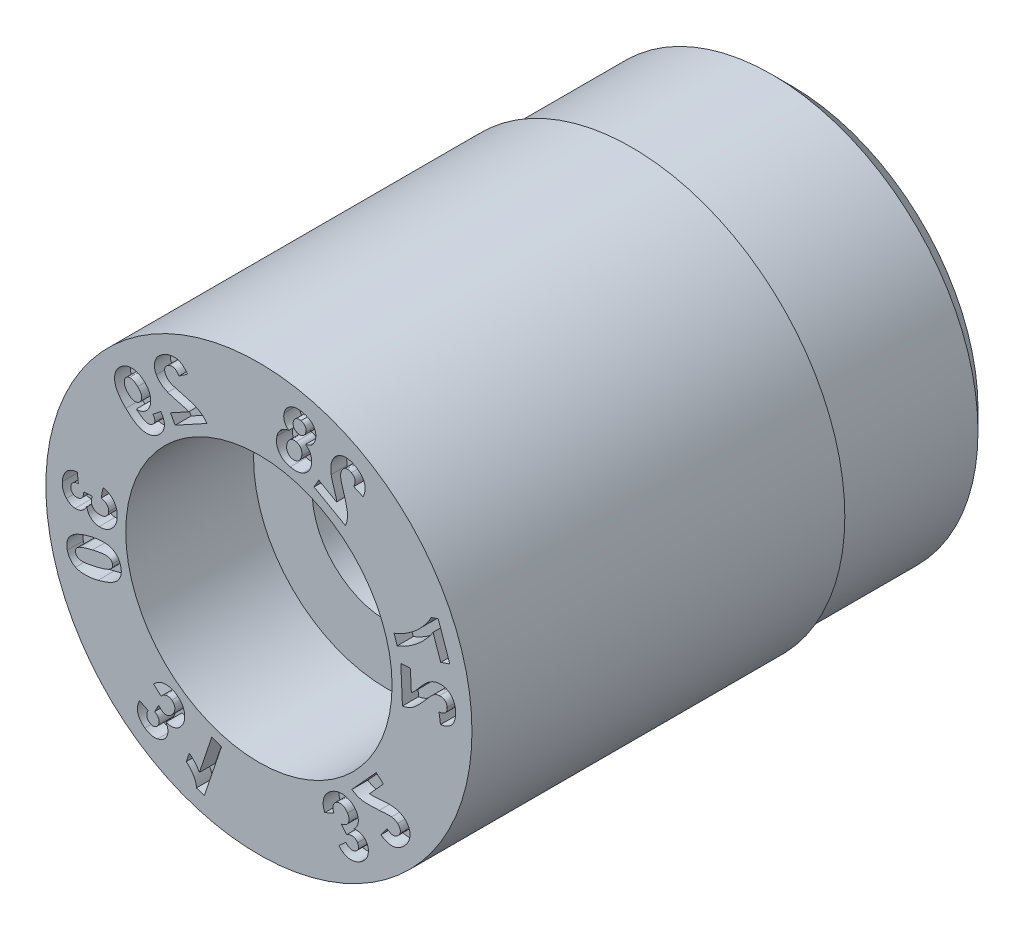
from build123d import *

# Parameters (mm, degrees)
SKETCH5_W          = 1.5
SKETCH5_H          = 1
CUT_EXTRUDE1_DEPTH = 0.15


with BuildPart() as part:
    # Sketch1 → Revolve1 (revolve)
    with BuildSketch(Plane(origin=(0, 0, 0), x_dir=(0, 0, -1), z_dir=(1, 0, 0)), mode=Mode.PRIVATE) as revolve1_sk:
        Polygon((0, 2), (0, 1.25), (1.2, 1.25), (1.2, 0.7), (5, 0.7), (5, 1.75), (4.75, 2), align=None)
    revolve(revolve1_sk.sketch.rotate(Axis((0, 0, 3.797909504), (0, 0, -1)), 90), axis=Axis((0, 0, 3.797909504), (0, 0, -1)))

    # Sketch5 → Cut-Revolve1 (revolve, cut)
    with BuildSketch(Plane(origin=(0, 0, 0), x_dir=(0, 0, -1), z_dir=(1, 0, 0)), mode=Mode.PRIVATE) as cut_revolve1_sk:
        with Locations((4.25, 2.435)):
            Rectangle(SKETCH5_W, SKETCH5_H)
    revolve(cut_revolve1_sk.sketch.rotate(Axis((0, 0, 0), (0, 0, -1)), 90), axis=Axis((0, 0, 0), (0, 0, -1)), mode=Mode.SUBTRACT)

    # Sketch7 → Cut-Extrude1 (cut)
    # profile 1 of 12: a face of its own
    with BuildSketch(Plane.XY):
        with BuildLine():
            Line((1.42206353, 0.225602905), (1.332058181, 0.221603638))
            Line((1.332058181, 0.221603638), (1.347374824, -0.118067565))
            add(Edge.make_bspline(
                [(1.347374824, -0.118067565), (1.355744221, -0.116495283), (1.372475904, -0.113352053), (1.396806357, -0.1051368), (1.420393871, -0.094425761), (1.439424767, -0.083049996), (1.454680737, -0.072050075), (1.467094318, -0.062069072), (1.48025521, -0.050239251), (1.494431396, -0.036859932), (1.509273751, -0.021554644), (1.525101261, -0.004685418), (1.541803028, 0.013906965), (1.553005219, 0.02705333), (1.558800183, 0.033854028)],
                knots=[0, 0, 0, 0, 1.148553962, 2.296132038, 3.456551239, 4.641022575, 5.282091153, 5.994920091, 6.790343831, 7.670677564, 8.626179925, 9.668176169, 10.793732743, 12, 12, 12, 12], degree=3))
            add(Edge.make_bspline(
                [(1.558800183, 0.033854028), (1.563437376, 0.039268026), (1.572273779, 0.049584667), (1.585070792, 0.064184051), (1.596648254, 0.077204), (1.60716724, 0.088495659), (1.616429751, 0.098219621), (1.624681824, 0.106185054), (1.631567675, 0.112754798), (1.636037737, 0.116270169), (1.638006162, 0.117818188)],
                knots=[0, 0, 0, 0, 1.480306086, 2.820796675, 4.031597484, 5.098139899, 6.025527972, 6.819659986, 7.480228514, 8, 8, 8, 8], degree=3))
            add(Edge.make_bspline(
                [(1.638006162, 0.117818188), (1.642775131, 0.121088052), (1.651985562, 0.127403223), (1.666744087, 0.134364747), (1.681493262, 0.139129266), (1.691498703, 0.140080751), (1.696397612, 0.140546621)],
                knots=[0, 0, 0, 0, 1.090623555, 2.106349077, 3.072822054, 4, 4, 4, 4], degree=3))
            add(Edge.make_bspline(
                [(1.696397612, 0.140546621), (1.701515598, 0.140603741), (1.711255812, 0.140712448), (1.725044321, 0.13798914), (1.737138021, 0.133078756), (1.74727216, 0.125686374), (1.755531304, 0.116356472), (1.76144006, 0.105053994), (1.765472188, 0.092158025), (1.766191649, 0.082900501), (1.766567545, 0.078063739)],
                knots=[0, 0, 0, 0, 1.148923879, 2.186556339, 3.139259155, 4.062488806, 4.98342693, 5.916961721, 6.91167875, 8, 8, 8, 8], degree=3))
            add(Edge.make_bspline(
                [(1.766567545, 0.078063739), (1.766592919, 0.073250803), (1.766641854, 0.063969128), (1.763795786, 0.050691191), (1.758416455, 0.03888694), (1.751956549, 0.03038769), (1.745736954, 0.0243281), (1.740097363, 0.02035429), (1.73381458, 0.016712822), (1.726664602, 0.013647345), (1.718826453, 0.010903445), (1.710157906, 0.008577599), (1.700701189, 0.006888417), (1.694132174, 0.006024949), (1.690751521, 0.005580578)],
                knots=[0, 0, 0, 0, 1.459760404, 2.815126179, 4.090002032, 5.372544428, 6.035320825, 6.722307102, 7.46331364, 8.239073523, 9.08258665, 9.986196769, 10.963624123, 12, 12, 12, 12], degree=3))
            Line((1.690751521, 0.005580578), (1.704626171, -0.090521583))
            add(Edge.make_bspline(
                [(1.704626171, -0.090521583), (1.711040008, -0.089448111), (1.723492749, -0.087363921), (1.74122149, -0.082525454), (1.757556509, -0.076834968), (1.77241486, -0.069970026), (1.785845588, -0.062035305), (1.797768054, -0.052910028), (1.808253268, -0.042703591), (1.817187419, -0.031370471), (1.824836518, -0.0192127), (1.831419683, -0.006423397), (1.836785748, 0.00705957), (1.841096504, 0.02116071), (1.844324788, 0.035949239), (1.846254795, 0.051439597), (1.847266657, 0.067560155), (1.846926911, 0.078496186), (1.846753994, 0.084062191)],
                knots=[0, 0, 0, 0, 1.238448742, 2.404501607, 3.496772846, 4.531290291, 5.518081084, 6.463197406, 7.385471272, 8.29886776, 9.206088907, 10.118862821, 11.035917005, 11.967390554, 12.925867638, 13.916172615, 14.939414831, 16, 16, 16, 16], degree=3))
            add(Edge.make_bspline(
                [(1.846753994, 0.084062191), (1.846391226, 0.090151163), (1.845685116, 0.102003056), (1.842836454, 0.119173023), (1.838970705, 0.135290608), (1.834024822, 0.150423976), (1.827567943, 0.164378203), (1.820070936, 0.177359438), (1.811269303, 0.189269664), (1.801326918, 0.200005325), (1.790502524, 0.209506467), (1.779093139, 0.217794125), (1.767050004, 0.224643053), (1.754497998, 0.230130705), (1.741385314, 0.234280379), (1.727679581, 0.23687261), (1.713445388, 0.238382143), (1.703800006, 0.238198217), (1.698906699, 0.238104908)],
                knots=[0, 0, 0, 0, 1.219676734, 2.374042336, 3.476384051, 4.534044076, 5.553349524, 6.546986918, 7.52854388, 8.509769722, 9.468816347, 10.405901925, 11.326343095, 12.234982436, 13.142215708, 14.071565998, 15.021664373, 16, 16, 16, 16], degree=3))
            add(Edge.make_bspline(
                [(1.698906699, 0.238104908), (1.693294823, 0.237728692), (1.682146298, 0.236981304), (1.665758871, 0.233721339), (1.649743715, 0.229309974), (1.634141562, 0.223088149), (1.618635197, 0.215263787), (1.603090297, 0.205577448), (1.587214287, 0.194187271), (1.576891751, 0.185588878), (1.571556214, 0.181144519)],
                knots=[0, 0, 0, 0, 0.947334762, 1.88197068, 2.810964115, 3.744753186, 4.70856007, 5.735617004, 6.829580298, 8, 8, 8, 8], degree=3))
            add(Edge.make_bspline(
                [(1.571556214, 0.181144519), (1.569644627, 0.179450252), (1.565575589, 0.175843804), (1.559360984, 0.169823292), (1.552553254, 0.162926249), (1.545150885, 0.155081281), (1.53719052, 0.146289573), (1.528538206, 0.136702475), (1.519441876, 0.126099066), (1.509985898, 0.114920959), (1.500726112, 0.103735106), (1.491887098, 0.093486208), (1.484000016, 0.084228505), (1.476921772, 0.076116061), (1.470691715, 0.069081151), (1.465259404, 0.063206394), (1.460784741, 0.058302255), (1.453741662, 0.051451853), (1.44422494, 0.042651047), (1.435094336, 0.03620304), (1.430758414, 0.033141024)],
                knots=[0, 0, 0, 0, 0.673618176, 1.433875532, 2.281433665, 3.229447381, 4.278293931, 5.409402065, 6.635280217, 7.962640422, 9.270932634, 10.464975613, 11.532007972, 12.478488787, 13.30450082, 14.010169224, 14.588975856, 15.054720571, 16.601352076, 18, 18, 18, 18], degree=3))
            Line((1.430758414, 0.033141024), (1.42206353, 0.225602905))
        make_face()
    # profile 2 of 12: a face of its own
    with BuildSketch(Plane.XY):
        with BuildLine():
            Line((1.706750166, 0.416768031), (1.79178262, 0.446199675))
            Line((1.79178262, 0.446199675), (1.683130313, 0.759139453))
            Line((1.683130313, 0.759139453), (1.616684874, 0.736163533))
            add(Edge.make_bspline(
                [(1.616684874, 0.736163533), (1.614512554, 0.731746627), (1.610034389, 0.722641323), (1.602251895, 0.70909123), (1.593588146, 0.695058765), (1.583888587, 0.680627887), (1.572966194, 0.665899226), (1.561256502, 0.650597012), (1.548362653, 0.635053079), (1.529962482, 0.61373981), (1.505389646, 0.587600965), (1.473732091, 0.558083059), (1.440043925, 0.530641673), (1.410564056, 0.509628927), (1.386518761, 0.493955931), (1.368696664, 0.483065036), (1.351243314, 0.472882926), (1.334062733, 0.463635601), (1.31718622, 0.455260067), (1.300568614, 0.447806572), (1.28432362, 0.440989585), (1.273443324, 0.437137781), (1.268102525, 0.43524705)],
                knots=[0, 0, 0, 0, 0.627744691, 1.294074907, 1.992187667, 2.731292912, 3.51120808, 4.330903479, 5.188931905, 6.086905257, 7.922593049, 9.762085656, 11.604223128, 13.461175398, 14.377156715, 15.265144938, 16.125227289, 16.954398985, 17.753566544, 18.527957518, 19.277420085, 20, 20, 20, 20], degree=3))
            Line((1.268102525, 0.43524705), (1.298675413, 0.346951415))
            add(Edge.make_bspline(
                [(1.298675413, 0.346951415), (1.306854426, 0.350124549), (1.32327448, 0.356494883), (1.347368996, 0.367568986), (1.371300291, 0.379566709), (1.394892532, 0.392875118), (1.418238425, 0.407359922), (1.441255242, 0.423092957), (1.46408893, 0.439869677), (1.48645932, 0.457839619), (1.508338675, 0.476552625), (1.529205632, 0.496082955), (1.549280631, 0.515997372), (1.56830633, 0.536575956), (1.586270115, 0.557840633), (1.603460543, 0.579516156), (1.619587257, 0.601839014), (1.629579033, 0.617191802), (1.634566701, 0.624855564)],
                knots=[0, 0, 0, 0, 0.949944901, 1.907093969, 2.870560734, 3.848635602, 4.839587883, 5.845229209, 6.867406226, 7.907511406, 8.952216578, 9.984721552, 11.002163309, 12.014175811, 13.018869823, 14.01631439, 15.009789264, 16, 16, 16, 16], degree=3))
            Line((1.634566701, 0.624855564), (1.706750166, 0.416768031))
        make_face()
    # profile 3 of 12: a face of its own
    with BuildSketch(Plane.XY):
        with BuildLine():
            Line((0.561679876, 1.325738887), (0.517502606, 1.247403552))
            Line((0.517502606, 1.247403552), (0.813020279, 1.08080397))
            add(Edge.make_bspline(
                [(0.813020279, 1.08080397), (0.816144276, 1.088723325), (0.822390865, 1.104558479), (0.828269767, 1.129495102), (0.831553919, 1.15510671), (0.832083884, 1.177162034), (0.830849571, 1.19591558), (0.82886238, 1.21169218), (0.825975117, 1.229137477), (0.821996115, 1.248191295), (0.81709413, 1.26891773), (0.811211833, 1.291234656), (0.80421573, 1.315178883), (0.799097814, 1.331640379), (0.796439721, 1.340189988)],
                knots=[0, 0, 0, 0, 1.150214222, 2.299911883, 3.45372636, 4.638216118, 5.276855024, 5.994265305, 6.787992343, 7.667915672, 8.626358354, 9.668420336, 10.789047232, 12, 12, 12, 12], degree=3))
            add(Edge.make_bspline(
                [(0.796439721, 1.340189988), (0.79431596, 1.34698552), (0.790265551, 1.35994587), (0.784495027, 1.378426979), (0.779626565, 1.3951159), (0.775696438, 1.410010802), (0.772240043, 1.42299656), (0.769808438, 1.434199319), (0.767988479, 1.443541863), (0.767318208, 1.449203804), (0.767020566, 1.451718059)],
                knots=[0, 0, 0, 0, 1.479578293, 2.821832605, 4.023515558, 5.091869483, 6.023248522, 6.815499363, 7.474007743, 8, 8, 8, 8], degree=3))
            add(Edge.make_bspline(
                [(0.767020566, 1.451718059), (0.766749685, 1.457475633), (0.766226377, 1.468598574), (0.768274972, 1.484722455), (0.772064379, 1.49968785), (0.77654565, 1.508639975), (0.778745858, 1.513035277)],
                knots=[0, 0, 0, 0, 1.09070401, 2.107108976, 3.070631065, 4, 4, 4, 4], degree=3))
            add(Edge.make_bspline(
                [(0.778745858, 1.513035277), (0.78140761, 1.517382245), (0.786477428, 1.525661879), (0.795989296, 1.535968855), (0.806561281, 1.543608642), (0.818182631, 1.54830822), (0.830448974, 1.550263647), (0.843143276, 1.549467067), (0.856131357, 1.545826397), (0.864383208, 1.541624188), (0.868699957, 1.539425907)],
                knots=[0, 0, 0, 0, 1.146908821, 2.184507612, 3.138916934, 4.064009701, 4.983479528, 5.916153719, 6.909887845, 8, 8, 8, 8], degree=3))
            add(Edge.make_bspline(
                [(0.868699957, 1.539425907), (0.872824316, 1.536914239), (0.880741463, 1.532092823), (0.890362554, 1.522502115), (0.897706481, 1.511823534), (0.90152589, 1.501787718), (0.903190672, 1.493282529), (0.903686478, 1.486443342), (0.903359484, 1.479185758), (0.902289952, 1.471478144), (0.900292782, 1.463386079), (0.897711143, 1.454845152), (0.894202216, 1.44595444), (0.891470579, 1.439966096), (0.890059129, 1.43687189)],
                knots=[0, 0, 0, 0, 1.464838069, 2.811913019, 4.098318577, 5.382886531, 6.04508973, 6.730949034, 7.46380774, 8.251941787, 9.094592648, 9.997286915, 10.965188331, 12, 12, 12, 12], degree=3))
            Line((0.890059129, 1.43687189), (0.978746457, 1.397886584))
            add(Edge.make_bspline(
                [(0.978746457, 1.397886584), (0.981188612, 1.403895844), (0.985929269, 1.415560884), (0.991365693, 1.43308308), (0.995094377, 1.449961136), (0.997204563, 1.466170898), (0.997560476, 1.481741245), (0.996116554, 1.496636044), (0.993093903, 1.510895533), (0.988194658, 1.524417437), (0.981894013, 1.537255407), (0.97458375, 1.549614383), (0.966017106, 1.561335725), (0.956308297, 1.572446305), (0.945380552, 1.582855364), (0.933411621, 1.592750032), (0.920256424, 1.602015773), (0.910871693, 1.607588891), (0.906090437, 1.610428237)],
                knots=[0, 0, 0, 0, 1.238463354, 2.404077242, 3.499009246, 4.536122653, 5.521338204, 6.466784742, 7.388257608, 8.29773923, 9.205754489, 10.116351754, 11.036745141, 11.97453175, 12.930612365, 13.915913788, 14.938216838, 16, 16, 16, 16], degree=3))
            add(Edge.make_bspline(
                [(0.906090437, 1.610428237), (0.900737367, 1.613289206), (0.890299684, 1.618867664), (0.874387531, 1.625822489), (0.858679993, 1.631006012), (0.843228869, 1.634721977), (0.828026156, 1.636736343), (0.813040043, 1.637258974), (0.798339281, 1.63597113), (0.783975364, 1.633248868), (0.770185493, 1.629193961), (0.757177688, 1.623835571), (0.745002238, 1.617365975), (0.733758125, 1.609552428), (0.723322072, 1.600604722), (0.71376563, 1.590448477), (0.704936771, 1.579206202), (0.700026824, 1.57090894), (0.697534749, 1.566697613)],
                knots=[0, 0, 0, 0, 1.216338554, 2.371677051, 3.475580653, 4.527837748, 5.552296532, 6.544407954, 7.527366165, 8.503641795, 9.470542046, 10.403125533, 11.319047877, 12.228537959, 13.141989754, 14.069337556, 15.020080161, 16, 16, 16, 16], degree=3))
            add(Edge.make_bspline(
                [(0.697534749, 1.566697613), (0.694878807, 1.561745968), (0.689602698, 1.551909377), (0.683701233, 1.536308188), (0.678907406, 1.520461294), (0.676038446, 1.504006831), (0.674436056, 1.486802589), (0.674380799, 1.468552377), (0.675411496, 1.449064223), (0.677278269, 1.435778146), (0.678243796, 1.428906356)],
                knots=[0, 0, 0, 0, 0.949032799, 1.885282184, 2.814423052, 3.74441981, 4.70366727, 5.732658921, 6.827291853, 8, 8, 8, 8], degree=3))
            add(Edge.make_bspline(
                [(0.678243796, 1.428906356), (0.678673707, 1.426387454), (0.679589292, 1.421022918), (0.681446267, 1.412517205), (0.683575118, 1.403014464), (0.686358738, 1.392602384), (0.689517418, 1.381224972), (0.693188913, 1.368871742), (0.697343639, 1.355536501), (0.701819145, 1.341600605), (0.706377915, 1.327882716), (0.710398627, 1.315015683), (0.714075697, 1.303487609), (0.717209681, 1.293199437), (0.719800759, 1.28415401), (0.72198328, 1.2764343), (0.723744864, 1.27003168), (0.725942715, 1.260503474), (0.728166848, 1.247786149), (0.728832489, 1.236675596), (0.729149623, 1.231382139)],
                knots=[0, 0, 0, 0, 0.674816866, 1.437165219, 2.298982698, 3.246640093, 4.283218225, 5.41764925, 6.650172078, 7.972220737, 9.283455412, 10.468016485, 11.532585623, 12.479346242, 13.308438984, 14.017625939, 14.598302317, 15.061926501, 16.600198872, 18, 18, 18, 18], degree=3))
            Line((0.729149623, 1.231382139), (0.561679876, 1.325738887))
        make_face()
    # profile 4 of 12: a face of its own
    with BuildSketch(Plane.XY):
        with BuildLine():
            add(Edge.make_bspline(
                [(0.438217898, 1.554112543), (0.444548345, 1.555456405), (0.456756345, 1.558047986), (0.473695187, 1.564744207), (0.488572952, 1.573341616), (0.501155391, 1.584101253), (0.511493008, 1.596443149), (0.520124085, 1.609818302), (0.526832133, 1.624373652), (0.529580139, 1.634723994), (0.530971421, 1.639964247)],
                knots=[0, 0, 0, 0, 1.152219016, 2.222006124, 3.232455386, 4.202850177, 5.157212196, 6.093359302, 7.034690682, 8, 8, 8, 8], degree=3))
            add(Edge.make_bspline(
                [(0.530971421, 1.639964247), (0.531863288, 1.644473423), (0.533617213, 1.653341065), (0.53473459, 1.666651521), (0.53459244, 1.679645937), (0.533071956, 1.692334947), (0.530065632, 1.70464122), (0.525869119, 1.716640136), (0.520256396, 1.728289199), (0.513385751, 1.739615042), (0.505164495, 1.75033907), (0.495681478, 1.760254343), (0.484844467, 1.769160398), (0.472754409, 1.777196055), (0.459416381, 1.784344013), (0.444832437, 1.790583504), (0.429025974, 1.796045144), (0.417893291, 1.798753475), (0.412160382, 1.800148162)],
                knots=[0, 0, 0, 0, 0.980764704, 1.928749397, 2.845695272, 3.751300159, 4.650637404, 5.545200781, 6.460415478, 7.406222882, 8.368706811, 9.339666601, 10.32893757, 11.357171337, 12.434439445, 13.554978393, 14.740906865, 16, 16, 16, 16], degree=3))
            add(Edge.make_bspline(
                [(0.412160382, 1.800148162), (0.406476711, 1.801351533), (0.395395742, 1.803697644), (0.378914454, 1.805498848), (0.363163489, 1.806109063), (0.348117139, 1.80564052), (0.333835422, 1.803359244), (0.320239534, 1.800043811), (0.307352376, 1.795266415), (0.295276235, 1.789168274), (0.284140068, 1.781930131), (0.273970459, 1.773832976), (0.264894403, 1.764849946), (0.256817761, 1.755020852), (0.250037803, 1.744193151), (0.244093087, 1.73262596), (0.239366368, 1.720115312), (0.237136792, 1.711344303), (0.236002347, 1.706881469)],
                knots=[0, 0, 0, 0, 1.24161571, 2.420672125, 3.539360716, 4.611062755, 5.633024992, 6.625960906, 7.599237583, 8.56488446, 9.512769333, 10.434448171, 11.339641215, 12.238603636, 13.148121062, 14.065879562, 15.015887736, 16, 16, 16, 16], degree=3))
            add(Edge.make_bspline(
                [(0.236002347, 1.706881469), (0.234965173, 1.701280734), (0.232924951, 1.690263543), (0.232630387, 1.67360807), (0.234845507, 1.657388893), (0.239530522, 1.641757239), (0.24650316, 1.626965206), (0.255726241, 1.613231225), (0.267139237, 1.600684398), (0.276113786, 1.593533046), (0.28068631, 1.58988944)],
                knots=[0, 0, 0, 0, 1.026689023, 2.019597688, 2.991258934, 3.970279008, 4.953226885, 5.931417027, 6.94605905, 8, 8, 8, 8], degree=3))
            add(Edge.make_bspline(
                [(0.28068631, 1.58988944), (0.277018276, 1.589232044), (0.269851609, 1.587947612), (0.259379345, 1.585278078), (0.249475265, 1.581928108), (0.240012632, 1.577982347), (0.23109932, 1.573480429), (0.222638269, 1.568360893), (0.214815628, 1.562507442), (0.204993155, 1.554056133), (0.194084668, 1.542148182), (0.183351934, 1.52589747), (0.174953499, 1.50781147), (0.17153563, 1.494794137), (0.169789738, 1.488144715)],
                knots=[0, 0, 0, 0, 0.834790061, 1.631027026, 2.418846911, 3.175452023, 3.926340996, 4.654396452, 5.388266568, 6.112674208, 7.556134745, 8.989191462, 10.46204006, 12, 12, 12, 12], degree=3))
            add(Edge.make_bspline(
                [(0.169789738, 1.488144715), (0.16863467, 1.482584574), (0.166372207, 1.471693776), (0.164872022, 1.455328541), (0.164811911, 1.439474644), (0.166394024, 1.42410727), (0.169341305, 1.409219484), (0.174004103, 1.394808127), (0.180121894, 1.380863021), (0.187816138, 1.367551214), (0.196897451, 1.355129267), (0.207058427, 1.343525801), (0.218682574, 1.333324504), (0.231296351, 1.323989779), (0.245279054, 1.316065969), (0.260300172, 1.309038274), (0.276628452, 1.303339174), (0.288011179, 1.300433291), (0.293850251, 1.298942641)],
                knots=[0, 0, 0, 0, 1.069276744, 2.094421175, 3.090311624, 4.052110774, 5.000481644, 5.944610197, 6.900182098, 7.864823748, 8.835252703, 9.795766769, 10.764412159, 11.74352101, 12.74746131, 13.787023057, 14.864794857, 16, 16, 16, 16], degree=3))
            add(Edge.make_bspline(
                [(0.293850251, 1.298942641), (0.299337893, 1.297812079), (0.310112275, 1.295592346), (0.326235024, 1.293724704), (0.341907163, 1.292924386), (0.35713739, 1.293711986), (0.37194303, 1.295309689), (0.386236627, 1.298632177), (0.400157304, 1.302848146), (0.408994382, 1.306791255), (0.413404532, 1.308759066)],
                knots=[0, 0, 0, 0, 1.099450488, 2.158649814, 3.183099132, 4.176088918, 5.149806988, 6.102058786, 7.05283093, 8, 8, 8, 8], degree=3))
            add(Edge.make_bspline(
                [(0.413404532, 1.308759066), (0.418429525, 1.311322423), (0.428322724, 1.316369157), (0.441700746, 1.326028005), (0.453874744, 1.33668479), (0.46448839, 1.348861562), (0.473532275, 1.362458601), (0.481344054, 1.377285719), (0.487630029, 1.393505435), (0.490546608, 1.404937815), (0.492035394, 1.410773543)],
                knots=[0, 0, 0, 0, 1.011957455, 1.99234065, 2.954655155, 3.913443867, 4.884121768, 5.881927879, 6.918817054, 8, 8, 8, 8], degree=3))
            add(Edge.make_bspline(
                [(0.492035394, 1.410773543), (0.49326141, 1.417349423), (0.495684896, 1.430348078), (0.49612664, 1.45008729), (0.49402832, 1.469559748), (0.48998586, 1.485437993), (0.485503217, 1.497865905), (0.481115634, 1.50684136), (0.476076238, 1.515588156), (0.470087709, 1.523925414), (0.463413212, 1.532096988), (0.455734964, 1.53974845), (0.447373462, 1.547222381), (0.441309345, 1.551786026), (0.438217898, 1.554112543)],
                knots=[0, 0, 0, 0, 1.475919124, 2.917474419, 4.343473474, 5.791376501, 6.525644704, 7.258871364, 7.995525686, 8.753354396, 9.52425487, 10.323918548, 11.14554464, 12, 12, 12, 12], degree=3))
        make_face()
        with BuildLine():
            add(Edge.make_bspline(
                [(0.440218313, 1.653397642), (0.439051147, 1.64895359), (0.436833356, 1.640509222), (0.430898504, 1.629318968), (0.423701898, 1.619873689), (0.414599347, 1.612784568), (0.404303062, 1.607805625), (0.392964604, 1.605221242), (0.380765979, 1.604808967), (0.372570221, 1.606292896), (0.368310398, 1.607064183)],
                knots=[0, 0, 0, 0, 1.136617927, 2.159745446, 3.121302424, 4.062401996, 4.994197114, 5.937873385, 6.928190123, 8, 8, 8, 8], degree=3))
            add(Edge.make_bspline(
                [(0.368310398, 1.607064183), (0.364071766, 1.608187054), (0.355935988, 1.610342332), (0.34503932, 1.616068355), (0.33587838, 1.623361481), (0.328756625, 1.632439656), (0.323656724, 1.642919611), (0.32089343, 1.654593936), (0.320647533, 1.667332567), (0.322192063, 1.675903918), (0.323003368, 1.680406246)],
                knots=[0, 0, 0, 0, 1.077371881, 2.067945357, 3.00809775, 3.94239197, 4.885795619, 5.858043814, 6.874881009, 8, 8, 8, 8], degree=3))
            add(Edge.make_bspline(
                [(0.323003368, 1.680406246), (0.324154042, 1.684594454), (0.326363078, 1.692634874), (0.331982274, 1.703480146), (0.339372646, 1.712459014), (0.348371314, 1.719445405), (0.358558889, 1.724575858), (0.369807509, 1.727296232), (0.381909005, 1.727807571), (0.390016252, 1.726347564), (0.394245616, 1.725585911)],
                knots=[0, 0, 0, 0, 1.095625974, 2.103356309, 3.061637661, 4.012505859, 4.963023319, 5.923004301, 6.916479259, 8, 8, 8, 8], degree=3))
            add(Edge.make_bspline(
                [(0.394245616, 1.725585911), (0.398514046, 1.724446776), (0.406709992, 1.722259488), (0.417747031, 1.716489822), (0.42698695, 1.709039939), (0.434142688, 1.699840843), (0.439198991, 1.689456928), (0.441992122, 1.678086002), (0.442494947, 1.665866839), (0.440995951, 1.657656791), (0.440218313, 1.653397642)],
                knots=[0, 0, 0, 0, 1.096809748, 2.106018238, 3.074282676, 4.029512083, 4.982595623, 5.927845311, 6.925022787, 8, 8, 8, 8], degree=3))
        make_face(mode=Mode.SUBTRACT)
        with BuildLine():
            add(Edge.make_bspline(
                [(0.401225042, 1.440884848), (0.400467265, 1.437746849), (0.398993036, 1.431641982), (0.395881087, 1.422963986), (0.392558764, 1.414870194), (0.3885762, 1.407472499), (0.383992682, 1.400852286), (0.379069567, 1.394714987), (0.373549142, 1.38934566), (0.367572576, 1.384701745), (0.361260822, 1.380812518), (0.354786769, 1.37756545), (0.348104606, 1.37519455), (0.341369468, 1.37333658), (0.334389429, 1.37251604), (0.327290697, 1.372249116), (0.320008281, 1.372902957), (0.315178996, 1.37382614), (0.312711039, 1.374297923)],
                knots=[0, 0, 0, 0, 1.243989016, 2.420137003, 3.550753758, 4.615783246, 5.652170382, 6.652312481, 7.645272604, 8.614323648, 9.565139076, 10.500409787, 11.40120802, 12.295762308, 13.188193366, 14.104462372, 15.031304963, 16, 16, 16, 16], degree=3))
            add(Edge.make_bspline(
                [(0.312711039, 1.374297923), (0.308101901, 1.375596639), (0.299106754, 1.378131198), (0.287052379, 1.385142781), (0.276843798, 1.394427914), (0.270158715, 1.404009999), (0.265863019, 1.412623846), (0.263404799, 1.419701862), (0.261641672, 1.427204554), (0.260469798, 1.435123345), (0.260440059, 1.443507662), (0.260703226, 1.452345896), (0.261905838, 1.461608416), (0.26322204, 1.467866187), (0.263895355, 1.471067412)],
                knots=[0, 0, 0, 0, 1.406853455, 2.74560077, 4.066582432, 5.446100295, 6.160946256, 6.899090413, 7.648410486, 8.430686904, 9.25216392, 10.115441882, 11.03593563, 12, 12, 12, 12], degree=3))
            add(Edge.make_bspline(
                [(0.263895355, 1.471067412), (0.26457876, 1.473865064), (0.26591304, 1.479327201), (0.268648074, 1.487153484), (0.271888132, 1.494432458), (0.275643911, 1.501132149), (0.279932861, 1.507242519), (0.284779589, 1.512742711), (0.289972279, 1.517892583), (0.297740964, 1.5235512), (0.307997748, 1.529358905), (0.321430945, 1.533382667), (0.335628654, 1.534409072), (0.345049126, 1.532782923), (0.349902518, 1.531945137)],
                knots=[0, 0, 0, 0, 0.876578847, 1.711433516, 2.520580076, 3.30007644, 4.046807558, 4.788988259, 5.530589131, 6.268118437, 7.709921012, 9.097406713, 10.504594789, 12, 12, 12, 12], degree=3))
            add(Edge.make_bspline(
                [(0.349902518, 1.531945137), (0.352691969, 1.531247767), (0.35810164, 1.529895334), (0.365672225, 1.526894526), (0.372575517, 1.523448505), (0.378687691, 1.519226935), (0.384141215, 1.514478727), (0.388920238, 1.509125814), (0.392900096, 1.503067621), (0.397101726, 1.494284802), (0.401006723, 1.482857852), (0.403488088, 1.468845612), (0.403716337, 1.454732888), (0.402060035, 1.445526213), (0.401225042, 1.440884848)],
                knots=[0, 0, 0, 0, 0.8818324, 1.710165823, 2.494578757, 3.24574856, 3.983927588, 4.710163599, 5.441723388, 6.200998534, 7.694435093, 9.133448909, 10.554884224, 12, 12, 12, 12], degree=3))
        make_face(mode=Mode.SUBTRACT)
    # profile 5 of 12: a face of its own
    with BuildSketch(Plane.XY):
        with BuildLine():
            Line((-0.829671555, 1.177047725), (-0.786290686, 1.09790585))
            Line((-0.786290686, 1.09790585), (-0.487530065, 1.261592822))
            add(Edge.make_bspline(
                [(-0.487530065, 1.261592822), (-0.49261324, 1.268443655), (-0.502778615, 1.282144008), (-0.521054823, 1.300202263), (-0.540987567, 1.316751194), (-0.559578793, 1.328834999), (-0.57625474, 1.33764996), (-0.59071671, 1.344486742), (-0.607186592, 1.351149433), (-0.625518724, 1.357898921), (-0.645799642, 1.364600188), (-0.667950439, 1.371382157), (-0.692074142, 1.378144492), (-0.708832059, 1.382479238), (-0.717527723, 1.384728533)],
                knots=[0, 0, 0, 0, 1.148008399, 2.29579666, 3.45125573, 4.635231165, 5.275084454, 5.992262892, 6.789757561, 7.668268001, 8.624316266, 9.667545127, 10.789691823, 12, 12, 12, 12], degree=3))
            add(Edge.make_bspline(
                [(-0.717527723, 1.384728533), (-0.724436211, 1.386489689), (-0.73763841, 1.389855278), (-0.756367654, 1.395026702), (-0.773231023, 1.399580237), (-0.78798713, 1.404154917), (-0.800838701, 1.40815209), (-0.811690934, 1.411914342), (-0.820586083, 1.415321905), (-0.825736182, 1.417772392), (-0.828002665, 1.418850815)],
                knots=[0, 0, 0, 0, 1.477961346, 2.824400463, 4.028083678, 5.098697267, 6.026876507, 6.817992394, 7.479815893, 8, 8, 8, 8], degree=3))
            add(Edge.make_bspline(
                [(-0.828002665, 1.418850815), (-0.833059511, 1.421691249), (-0.842808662, 1.427167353), (-0.855596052, 1.437327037), (-0.86622413, 1.448585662), (-0.87151356, 1.457114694), (-0.874106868, 1.461296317)],
                knots=[0, 0, 0, 0, 1.093784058, 2.10871894, 3.072740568, 4, 4, 4, 4], degree=3))
            add(Edge.make_bspline(
                [(-0.874106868, 1.461296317), (-0.876412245, 1.465860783), (-0.880808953, 1.474565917), (-0.884374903, 1.48819631), (-0.885387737, 1.501251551), (-0.883227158, 1.513633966), (-0.878510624, 1.525120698), (-0.871025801, 1.535471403), (-0.861067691, 1.544674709), (-0.85304942, 1.549483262), (-0.848871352, 1.551988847)],
                knots=[0, 0, 0, 0, 1.145179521, 2.184032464, 3.141276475, 4.06283726, 4.979150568, 5.905361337, 6.908549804, 8, 8, 8, 8], degree=3))
            add(Edge.make_bspline(
                [(-0.848871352, 1.551988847), (-0.844533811, 1.554103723), (-0.836183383, 1.558175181), (-0.822991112, 1.561513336), (-0.810017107, 1.561924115), (-0.799470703, 1.560088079), (-0.791346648, 1.556978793), (-0.78523891, 1.553805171), (-0.7792168, 1.549675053), (-0.773272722, 1.544623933), (-0.76742551, 1.538646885), (-0.761539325, 1.531860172), (-0.755802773, 1.524149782), (-0.752165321, 1.518621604), (-0.750287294, 1.515767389)],
                knots=[0, 0, 0, 0, 1.461372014, 2.813364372, 4.091454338, 5.374961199, 6.0294369, 6.72441039, 7.45823037, 8.239942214, 9.087116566, 9.992573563, 10.963559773, 12, 12, 12, 12], degree=3))
            Line((-0.750287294, 1.515767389), (-0.669953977, 1.570875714))
            add(Edge.make_bspline(
                [(-0.669953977, 1.570875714), (-0.673788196, 1.576137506), (-0.681221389, 1.586338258), (-0.693252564, 1.60028038), (-0.705671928, 1.612344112), (-0.718335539, 1.622745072), (-0.731433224, 1.631271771), (-0.744902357, 1.637956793), (-0.758698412, 1.642867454), (-0.772793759, 1.646013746), (-0.787100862, 1.647447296), (-0.801528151, 1.647615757), (-0.816041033, 1.646563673), (-0.830685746, 1.644276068), (-0.845368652, 1.640418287), (-0.860193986, 1.635502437), (-0.875074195, 1.629142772), (-0.884806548, 1.624110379), (-0.889772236, 1.621542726)],
                knots=[0, 0, 0, 0, 1.238010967, 2.400065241, 3.497633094, 4.527679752, 5.512263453, 6.463623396, 7.381219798, 8.291009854, 9.203493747, 10.111183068, 11.032270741, 11.968247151, 12.926046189, 13.916408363, 14.936899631, 16, 16, 16, 16], degree=3))
            add(Edge.make_bspline(
                [(-0.889772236, 1.621542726), (-0.89504868, 1.618494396), (-0.905337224, 1.612550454), (-0.919619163, 1.602596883), (-0.932385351, 1.591972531), (-0.94375083, 1.580837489), (-0.953414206, 1.56883333), (-0.961820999, 1.556419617), (-0.968647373, 1.543246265), (-0.973833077, 1.529563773), (-0.977670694, 1.515644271), (-0.980013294, 1.501713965), (-0.980948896, 1.487859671), (-0.980353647, 1.47412511), (-0.978353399, 1.460479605), (-0.974718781, 1.446980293), (-0.969748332, 1.433536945), (-0.96532189, 1.424926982), (-0.963077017, 1.420560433)],
                knots=[0, 0, 0, 0, 1.216908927, 2.372852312, 3.472224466, 4.531791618, 5.545215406, 6.545424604, 7.522226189, 8.501488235, 9.463274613, 10.402075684, 11.318527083, 12.231943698, 13.143229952, 14.067600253, 15.019982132, 16, 16, 16, 16], degree=3))
            add(Edge.make_bspline(
                [(-0.963077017, 1.420560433), (-0.960228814, 1.415677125), (-0.954587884, 1.406005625), (-0.944607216, 1.392532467), (-0.933329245, 1.380315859), (-0.920974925, 1.368886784), (-0.907012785, 1.358519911), (-0.891580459, 1.34861186), (-0.874291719, 1.33947499), (-0.862020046, 1.334001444), (-0.855676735, 1.331172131)],
                knots=[0, 0, 0, 0, 0.951120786, 1.883715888, 2.815341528, 3.746455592, 4.71236903, 5.738459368, 6.830994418, 8, 8, 8, 8], degree=3))
            add(Edge.make_bspline(
                [(-0.855676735, 1.331172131), (-0.85330093, 1.330205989), (-0.848245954, 1.328150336), (-0.840068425, 1.325092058), (-0.83076315, 1.322123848), (-0.820442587, 1.318921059), (-0.809087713, 1.315508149), (-0.796576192, 1.312210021), (-0.783023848, 1.308568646), (-0.768775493, 1.305038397), (-0.754666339, 1.301665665), (-0.741595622, 1.298182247), (-0.729798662, 1.295194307), (-0.719372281, 1.292406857), (-0.71031679, 1.289834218), (-0.702552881, 1.287782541), (-0.696190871, 1.2857203), (-0.68680907, 1.282674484), (-0.674761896, 1.27783502), (-0.665039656, 1.272369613), (-0.660421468, 1.269773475)],
                knots=[0, 0, 0, 0, 0.674959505, 1.43610481, 2.296886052, 3.244836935, 4.280143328, 5.41677601, 6.649675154, 7.973185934, 9.279716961, 10.467220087, 11.532843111, 12.482360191, 13.307311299, 14.010364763, 14.595171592, 15.066853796, 16.606718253, 18, 18, 18, 18], degree=3))
            Line((-0.660421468, 1.269773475), (-0.829671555, 1.177047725))
        make_face()
    # profile 6 of 12: a face of its own
    with BuildSketch(Plane.XY):
        with BuildLine():
            Line((-0.921264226, 1.141867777), (-0.994753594, 1.082400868))
            add(Edge.make_bspline(
                [(-0.994753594, 1.082400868), (-0.992009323, 1.078757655), (-0.986814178, 1.071860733), (-0.981242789, 1.06084944), (-0.977740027, 1.050199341), (-0.976807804, 1.039771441), (-0.978062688, 1.02973069), (-0.981461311, 1.020069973), (-0.986960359, 1.010835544), (-0.991920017, 1.005412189), (-0.994482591, 1.00261003)],
                knots=[0, 0, 0, 0, 1.228030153, 2.324768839, 3.312731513, 4.234154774, 5.123951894, 6.021677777, 6.977832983, 8, 8, 8, 8], degree=3))
            add(Edge.make_bspline(
                [(-0.994482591, 1.00261003), (-0.996261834, 1.00090604), (-0.999796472, 0.997520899), (-1.005803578, 0.993403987), (-1.012217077, 0.990148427), (-1.018964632, 0.987593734), (-1.02619133, 0.985887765), (-1.033828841, 0.985016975), (-1.04187031, 0.984971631), (-1.05042623, 0.985670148), (-1.059740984, 0.987690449), (-1.069894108, 0.991373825), (-1.080992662, 0.996654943), (-1.093061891, 1.003563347), (-1.106081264, 1.01218676), (-1.120158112, 1.022372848), (-1.135194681, 1.034197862), (-1.145333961, 1.042847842), (-1.150625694, 1.047362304)],
                knots=[0, 0, 0, 0, 0.658005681, 1.307191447, 1.938499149, 2.578095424, 3.232054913, 3.918984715, 4.629361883, 5.379714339, 6.210486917, 7.169881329, 8.261554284, 9.494017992, 10.885812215, 12.435944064, 14.139904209, 16, 16, 16, 16], degree=3))
            add(Edge.make_bspline(
                [(-1.150625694, 1.047362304), (-1.146060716, 1.047175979), (-1.137058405, 1.046808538), (-1.123777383, 1.047899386), (-1.111054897, 1.0502518), (-1.09886969, 1.053968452), (-1.087283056, 1.059157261), (-1.076108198, 1.065482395), (-1.065587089, 1.073320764), (-1.05920007, 1.07941745), (-1.055953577, 1.082516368)],
                knots=[0, 0, 0, 0, 1.049898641, 2.070440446, 3.056721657, 4.020642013, 4.992420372, 5.970646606, 6.968488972, 8, 8, 8, 8], degree=3))
            add(Edge.make_bspline(
                [(-1.055953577, 1.082516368), (-1.052605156, 1.086090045), (-1.045975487, 1.093165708), (-1.037510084, 1.104906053), (-1.030331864, 1.117244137), (-1.024595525, 1.130254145), (-1.020335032, 1.143909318), (-1.017372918, 1.158205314), (-1.015962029, 1.173183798), (-1.015761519, 1.188606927), (-1.0171376, 1.204169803), (-1.020073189, 1.219536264), (-1.024478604, 1.234637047), (-1.030757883, 1.249256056), (-1.038367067, 1.263629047), (-1.047705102, 1.277519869), (-1.058427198, 1.29121487), (-1.066680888, 1.299661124), (-1.070894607, 1.303973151)],
                knots=[0, 0, 0, 0, 0.94828091, 1.877538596, 2.797752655, 3.710457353, 4.626686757, 5.565179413, 6.534516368, 7.53787854, 8.550746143, 9.556623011, 10.565612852, 11.592658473, 12.634692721, 13.712903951, 14.832379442, 16, 16, 16, 16], degree=3))
            add(Edge.make_bspline(
                [(-1.070894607, 1.303973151), (-1.075460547, 1.308302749), (-1.084374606, 1.3167554), (-1.098694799, 1.327758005), (-1.113234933, 1.337227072), (-1.128195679, 1.344987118), (-1.143503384, 1.35112646), (-1.159210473, 1.355480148), (-1.17522143, 1.358224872), (-1.191469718, 1.359149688), (-1.207611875, 1.358474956), (-1.223417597, 1.356312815), (-1.238700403, 1.352472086), (-1.25343923, 1.346930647), (-1.267750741, 1.339948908), (-1.281508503, 1.331253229), (-1.294761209, 1.320961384), (-1.30297243, 1.31311581), (-1.307158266, 1.30911637)],
                knots=[0, 0, 0, 0, 1.137060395, 2.219876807, 3.259918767, 4.27082666, 5.262193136, 6.236547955, 7.212458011, 8.193830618, 9.173347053, 10.129555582, 11.073412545, 12.016123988, 12.971797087, 13.947590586, 14.95374292, 16, 16, 16, 16], degree=3))
            add(Edge.make_bspline(
                [(-1.307158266, 1.30911637), (-1.311481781, 1.304538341), (-1.319990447, 1.295528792), (-1.330630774, 1.280593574), (-1.339495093, 1.265100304), (-1.346339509, 1.248876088), (-1.351178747, 1.231911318), (-1.354231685, 1.214276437), (-1.355059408, 1.19592955), (-1.354239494, 1.176923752), (-1.350994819, 1.157177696), (-1.344697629, 1.136906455), (-1.33566724, 1.116059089), (-1.323970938, 1.094574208), (-1.309256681, 1.072635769), (-1.291953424, 1.050036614), (-1.271801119, 1.026856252), (-1.256924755, 1.01174181), (-1.249200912, 1.003894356)],
                knots=[0, 0, 0, 0, 0.860004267, 1.692485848, 2.499812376, 3.296381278, 4.093276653, 4.906968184, 5.737272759, 6.599203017, 7.503953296, 8.46452846, 9.493449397, 10.605628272, 11.804029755, 13.101122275, 14.494895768, 16, 16, 16, 16], degree=3))
            add(Edge.make_bspline(
                [(-1.249200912, 1.003894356), (-1.241138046, 0.996118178), (-1.225583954, 0.981117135), (-1.2017341, 0.960892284), (-1.178570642, 0.943404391), (-1.155916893, 0.9288149), (-1.133790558, 0.917037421), (-1.112165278, 0.908205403), (-1.091183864, 0.901966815), (-1.070717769, 0.898909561), (-1.050975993, 0.898371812), (-1.031893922, 0.899560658), (-1.013488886, 0.903074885), (-0.995751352, 0.908587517), (-0.978674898, 0.916147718), (-0.962344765, 0.925802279), (-0.946681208, 0.937452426), (-0.937138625, 0.946565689), (-0.932269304, 0.95121594)],
                knots=[0, 0, 0, 0, 1.477789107, 2.850806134, 4.123443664, 5.304975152, 6.402744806, 7.425902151, 8.382698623, 9.283973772, 10.147491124, 10.984758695, 11.801862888, 12.613611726, 13.430814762, 14.260170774, 15.112212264, 16, 16, 16, 16], degree=3))
            add(Edge.make_bspline(
                [(-0.932269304, 0.95121594), (-0.928896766, 0.95469479), (-0.922301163, 0.961498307), (-0.913793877, 0.972517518), (-0.906230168, 0.983555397), (-0.899886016, 0.994806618), (-0.894874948, 1.006313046), (-0.890925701, 1.017953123), (-0.888305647, 1.029834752), (-0.886865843, 1.04189599), (-0.886696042, 1.054084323), (-0.887721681, 1.066402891), (-0.89012396, 1.078805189), (-0.893873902, 1.091266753), (-0.898862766, 1.103838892), (-0.90498721, 1.116559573), (-0.912554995, 1.129305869), (-0.918309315, 1.137605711), (-0.921264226, 1.141867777)],
                knots=[0, 0, 0, 0, 1.099479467, 2.15022934, 3.156317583, 4.13663374, 5.078112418, 6.002571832, 6.923628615, 7.835844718, 8.756414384, 9.687031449, 10.638116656, 11.619652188, 12.637941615, 13.70688972, 14.82246104, 16, 16, 16, 16], degree=3))
        make_face()
        with BuildLine():
            add(Edge.make_bspline(
                [(-1.226885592, 1.135092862), (-1.229538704, 1.137825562), (-1.234704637, 1.143146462), (-1.241626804, 1.151491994), (-1.247701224, 1.159778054), (-1.252675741, 1.168191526), (-1.256915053, 1.176497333), (-1.260121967, 1.18491928), (-1.262191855, 1.193389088), (-1.263520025, 1.201749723), (-1.264038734, 1.209892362), (-1.263656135, 1.217687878), (-1.262769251, 1.225066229), (-1.261080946, 1.232051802), (-1.258611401, 1.238603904), (-1.255328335, 1.244686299), (-1.251527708, 1.250476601), (-1.248365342, 1.253849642), (-1.246762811, 1.255558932)],
                knots=[0, 0, 0, 0, 1.345681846, 2.620206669, 3.829105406, 4.972729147, 6.070858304, 7.121800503, 8.149394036, 9.146870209, 10.110964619, 11.026977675, 11.901898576, 12.733873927, 13.56087179, 14.368729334, 15.17335256, 16, 16, 16, 16], degree=3))
            add(Edge.make_bspline(
                [(-1.246762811, 1.255558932), (-1.24354242, 1.258487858), (-1.23725549, 1.264205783), (-1.225734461, 1.269819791), (-1.213238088, 1.272747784), (-1.202182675, 1.272788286), (-1.192971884, 1.271431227), (-1.185707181, 1.269332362), (-1.178244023, 1.266144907), (-1.170586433, 1.262038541), (-1.162751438, 1.256940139), (-1.154652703, 1.250938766), (-1.146372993, 1.243905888), (-1.140960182, 1.238678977), (-1.138170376, 1.235984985)],
                knots=[0, 0, 0, 0, 1.254053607, 2.448195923, 3.660049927, 4.940871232, 5.619548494, 6.349030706, 7.121366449, 7.963507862, 8.859812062, 9.823391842, 10.878158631, 12, 12, 12, 12], degree=3))
            add(Edge.make_bspline(
                [(-1.138170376, 1.235984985), (-1.135377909, 1.233153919), (-1.130003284, 1.227705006), (-1.122841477, 1.219198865), (-1.11659744, 1.210935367), (-1.11141223, 1.20276221), (-1.107020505, 1.194855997), (-1.103899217, 1.186929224), (-1.101618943, 1.179198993), (-1.100395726, 1.171583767), (-1.10020374, 1.164222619), (-1.100447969, 1.157124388), (-1.101641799, 1.150326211), (-1.103553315, 1.143857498), (-1.106006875, 1.137604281), (-1.109424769, 1.131740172), (-1.11338436, 1.126041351), (-1.116613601, 1.122647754), (-1.118244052, 1.120934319)],
                knots=[0, 0, 0, 0, 1.45082596, 2.792385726, 4.055291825, 5.2278707, 6.323132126, 7.350262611, 8.330288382, 9.260163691, 10.15541929, 11.014481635, 11.848265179, 12.666147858, 13.474053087, 14.292690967, 15.137975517, 16, 16, 16, 16], degree=3))
            add(Edge.make_bspline(
                [(-1.118244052, 1.120934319), (-1.119895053, 1.119341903), (-1.123146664, 1.116205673), (-1.128614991, 1.112292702), (-1.134269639, 1.108884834), (-1.140344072, 1.106428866), (-1.146641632, 1.104488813), (-1.153232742, 1.103159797), (-1.160156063, 1.102769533), (-1.167310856, 1.102841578), (-1.174651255, 1.103819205), (-1.182080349, 1.105580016), (-1.189505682, 1.108298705), (-1.196911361, 1.111985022), (-1.204442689, 1.11638941), (-1.211960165, 1.121776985), (-1.219479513, 1.128077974), (-1.224366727, 1.132707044), (-1.226885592, 1.135092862)],
                knots=[0, 0, 0, 0, 0.89325474, 1.759246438, 2.615717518, 3.461519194, 4.306069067, 5.18379122, 6.07506973, 7.00498048, 7.970247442, 8.955761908, 9.976865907, 11.045806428, 12.177643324, 13.375555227, 14.647363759, 16, 16, 16, 16], degree=3))
        make_face(mode=Mode.SUBTRACT)
    # profile 7 of 12: a face of its own
    with BuildSketch(Plane.XY):
        with BuildLine():
            Line((-1.463128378, 0.252321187), (-1.479755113, 0.159209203))
            add(Edge.make_bspline(
                [(-1.479755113, 0.159209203), (-1.47414377, 0.157980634), (-1.463448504, 0.155638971), (-1.448758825, 0.149705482), (-1.436220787, 0.142020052), (-1.426076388, 0.132420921), (-1.418338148, 0.121477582), (-1.412832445, 0.109597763), (-1.409963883, 0.09669567), (-1.410042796, 0.087880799), (-1.410083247, 0.083362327)],
                knots=[0, 0, 0, 0, 1.211348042, 2.308839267, 3.328529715, 4.299375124, 5.236418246, 6.142911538, 7.048063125, 8, 8, 8, 8], degree=3))
            add(Edge.make_bspline(
                [(-1.410083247, 0.083362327), (-1.410265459, 0.080913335), (-1.410625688, 0.076071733), (-1.412249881, 0.069067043), (-1.414289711, 0.0623119), (-1.417217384, 0.055967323), (-1.420788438, 0.049956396), (-1.425089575, 0.044334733), (-1.430043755, 0.039018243), (-1.435634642, 0.034048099), (-1.441747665, 0.029456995), (-1.448551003, 0.025762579), (-1.455673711, 0.02249165), (-1.463346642, 0.02014549), (-1.471367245, 0.018206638), (-1.479916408, 0.017216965), (-1.488899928, 0.016615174), (-1.495049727, 0.016901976), (-1.4981938, 0.017048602)],
                knots=[0, 0, 0, 0, 0.952564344, 1.883197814, 2.786056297, 3.689689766, 4.589636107, 5.497134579, 6.433766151, 7.408216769, 8.400463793, 9.395440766, 10.409580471, 11.439813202, 12.506762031, 13.610474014, 14.778359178, 16, 16, 16, 16], degree=3))
            add(Edge.make_bspline(
                [(-1.4981938, 0.017048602), (-1.501148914, 0.017277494), (-1.506925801, 0.017724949), (-1.515346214, 0.019064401), (-1.52319977, 0.021160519), (-1.530658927, 0.023547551), (-1.537444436, 0.026903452), (-1.543900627, 0.030568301), (-1.549768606, 0.034960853), (-1.556725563, 0.041477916), (-1.564103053, 0.050409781), (-1.570317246, 0.062465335), (-1.573757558, 0.075520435), (-1.573756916, 0.084478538), (-1.573756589, 0.089045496)],
                knots=[0, 0, 0, 0, 0.913356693, 1.785500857, 2.622650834, 3.417270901, 4.19394381, 4.950572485, 5.703040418, 6.446154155, 7.886000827, 9.248325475, 10.597160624, 12, 12, 12, 12], degree=3))
            add(Edge.make_bspline(
                [(-1.573756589, 0.089045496), (-1.573481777, 0.092306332), (-1.572905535, 0.099143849), (-1.570681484, 0.109734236), (-1.567923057, 0.121249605), (-1.565326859, 0.129085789), (-1.563973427, 0.133170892)],
                knots=[0, 0, 0, 0, 0.865721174, 1.815296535, 2.861086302, 4, 4, 4, 4], degree=3))
            Line((-1.563973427, 0.133170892), (-1.643555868, 0.126962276))
            add(Edge.make_bspline(
                [(-1.643555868, 0.126962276), (-1.64370674, 0.123758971), (-1.643998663, 0.117560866), (-1.645142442, 0.108620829), (-1.646760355, 0.100265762), (-1.649127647, 0.092575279), (-1.651825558, 0.085405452), (-1.655271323, 0.078927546), (-1.659369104, 0.073135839), (-1.663855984, 0.067863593), (-1.668829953, 0.063245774), (-1.674225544, 0.059373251), (-1.679883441, 0.056049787), (-1.685907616, 0.053416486), (-1.692270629, 0.051471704), (-1.699014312, 0.050323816), (-1.706029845, 0.049618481), (-1.710825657, 0.049806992), (-1.713256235, 0.049902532)],
                knots=[0, 0, 0, 0, 1.302456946, 2.520135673, 3.658844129, 4.755326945, 5.785648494, 6.767153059, 7.726762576, 8.66314822, 9.575614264, 10.476573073, 11.356570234, 12.237002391, 13.141777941, 14.052248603, 15.012855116, 16, 16, 16, 16], degree=3))
            add(Edge.make_bspline(
                [(-1.713256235, 0.049902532), (-1.717293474, 0.050329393), (-1.725028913, 0.051147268), (-1.735953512, 0.054521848), (-1.745350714, 0.060018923), (-1.753253, 0.067175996), (-1.759620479, 0.075724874), (-1.763684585, 0.085750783), (-1.766216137, 0.096801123), (-1.766055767, 0.104553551), (-1.765972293, 0.108588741)],
                knots=[0, 0, 0, 0, 1.094932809, 2.097915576, 3.061752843, 4.011263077, 4.96166395, 5.91317695, 6.913794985, 8, 8, 8, 8], degree=3))
            add(Edge.make_bspline(
                [(-1.765972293, 0.108588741), (-1.765536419, 0.112596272), (-1.7646841, 0.120432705), (-1.760746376, 0.13155786), (-1.754622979, 0.141569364), (-1.746457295, 0.150453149), (-1.736250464, 0.157920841), (-1.724030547, 0.163404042), (-1.710034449, 0.167247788), (-1.700001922, 0.168138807), (-1.694727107, 0.168607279)],
                knots=[0, 0, 0, 0, 0.937912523, 1.834019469, 2.726174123, 3.658891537, 4.631453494, 5.6546076, 6.766859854, 8, 8, 8, 8], degree=3))
            Line((-1.694727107, 0.168607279), (-1.704871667, 0.258717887))
            add(Edge.make_bspline(
                [(-1.704871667, 0.258717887), (-1.712249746, 0.257490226), (-1.726386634, 0.255137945), (-1.746318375, 0.249790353), (-1.764059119, 0.243213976), (-1.779829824, 0.235298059), (-1.793639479, 0.225431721), (-1.805852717, 0.213676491), (-1.816827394, 0.200145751), (-1.826246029, 0.184757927), (-1.834030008, 0.167834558), (-1.839979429, 0.149684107), (-1.844130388, 0.13039554), (-1.84521913, 0.117117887), (-1.845776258, 0.110323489)],
                knots=[0, 0, 0, 0, 1.193477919, 2.286782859, 3.288491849, 4.209743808, 5.095087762, 5.98673507, 6.908195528, 7.868834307, 8.859059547, 9.875137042, 10.91267193, 12, 12, 12, 12], degree=3))
            add(Edge.make_bspline(
                [(-1.845776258, 0.110323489), (-1.845964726, 0.104504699), (-1.846333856, 0.093108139), (-1.845100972, 0.076385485), (-1.842606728, 0.0604319), (-1.83823389, 0.045397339), (-1.832711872, 0.031044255), (-1.825550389, 0.017566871), (-1.817006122, 0.004793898), (-1.810185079, -0.002872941), (-1.806738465, -0.006746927)],
                knots=[0, 0, 0, 0, 1.099163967, 2.152799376, 3.162892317, 4.143776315, 5.105031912, 6.063290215, 7.021397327, 8, 8, 8, 8], degree=3))
            add(Edge.make_bspline(
                [(-1.806738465, -0.006746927), (-1.803805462, -0.009752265), (-1.798033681, -0.015666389), (-1.788582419, -0.023397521), (-1.778821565, -0.030155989), (-1.768655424, -0.035703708), (-1.758190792, -0.040308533), (-1.747294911, -0.043516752), (-1.736079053, -0.04594085), (-1.728420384, -0.046581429), (-1.724547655, -0.046905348)],
                knots=[0, 0, 0, 0, 1.073444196, 2.112402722, 3.117768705, 4.106159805, 5.07069329, 6.036052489, 7.00689851, 8, 8, 8, 8], degree=3))
            add(Edge.make_bspline(
                [(-1.724547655, -0.046905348), (-1.719115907, -0.047010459), (-1.708404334, -0.047217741), (-1.692622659, -0.044582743), (-1.677619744, -0.039646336), (-1.663306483, -0.032411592), (-1.649845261, -0.022680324), (-1.637003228, -0.010769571), (-1.624911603, 0.003490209), (-1.617907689, 0.014267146), (-1.614277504, 0.019852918)],
                knots=[0, 0, 0, 0, 0.957712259, 1.888637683, 2.808857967, 3.737858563, 4.708696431, 5.732084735, 6.824521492, 8, 8, 8, 8], degree=3))
            add(Edge.make_bspline(
                [(-1.614277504, 0.019852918), (-1.613661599, 0.016261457), (-1.612441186, 0.009144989), (-1.60938869, -0.001094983), (-1.605981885, -0.010978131), (-1.601503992, -0.020189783), (-1.596475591, -0.029017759), (-1.590422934, -0.03712708), (-1.583935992, -0.045003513), (-1.576528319, -0.052140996), (-1.568581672, -0.058695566), (-1.56014217, -0.064529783), (-1.551246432, -0.069609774), (-1.541763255, -0.07371977), (-1.53191342, -0.077267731), (-1.521539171, -0.079886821), (-1.510727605, -0.081607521), (-1.503357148, -0.082222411), (-1.499622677, -0.082533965)],
                knots=[0, 0, 0, 0, 1.045078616, 2.070819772, 3.063270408, 4.042536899, 5.00645837, 5.975127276, 6.943302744, 7.932763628, 8.922514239, 9.89782013, 10.874692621, 11.857952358, 12.861082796, 13.877275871, 14.9244557, 16, 16, 16, 16], degree=3))
            add(Edge.make_bspline(
                [(-1.499622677, -0.082533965), (-1.49417607, -0.082678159), (-1.483412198, -0.082963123), (-1.467488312, -0.081591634), (-1.452109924, -0.078549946), (-1.437226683, -0.074100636), (-1.422874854, -0.067972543), (-1.409104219, -0.060228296), (-1.39586392, -0.050991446), (-1.383307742, -0.040328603), (-1.371633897, -0.028589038), (-1.361394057, -0.015755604), (-1.352484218, -0.002190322), (-1.344895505, 0.012202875), (-1.338992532, 0.027558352), (-1.334350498, 0.043639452), (-1.33113146, 0.060560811), (-1.330223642, 0.072160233), (-1.329760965, 0.078071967)],
                knots=[0, 0, 0, 0, 1.003514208, 1.983198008, 2.9378591, 3.887971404, 4.840732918, 5.80736515, 6.794458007, 7.811131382, 8.839302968, 9.840459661, 10.831176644, 11.826474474, 12.832653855, 13.857141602, 14.907876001, 16, 16, 16, 16], degree=3))
            add(Edge.make_bspline(
                [(-1.329760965, 0.078071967), (-1.32958079, 0.083682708), (-1.329227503, 0.09468425), (-1.330172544, 0.110928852), (-1.332378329, 0.126489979), (-1.335840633, 0.141418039), (-1.340552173, 0.155662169), (-1.346704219, 0.16921636), (-1.354081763, 0.182107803), (-1.362654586, 0.19426065), (-1.372190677, 0.205538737), (-1.382775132, 0.215619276), (-1.394092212, 0.224691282), (-1.406302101, 0.232547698), (-1.419264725, 0.239363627), (-1.433147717, 0.244774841), (-1.447778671, 0.249327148), (-1.457953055, 0.251311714), (-1.463128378, 0.252321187)],
                knots=[0, 0, 0, 0, 1.112402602, 2.181198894, 3.220967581, 4.22455965, 5.215193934, 6.190037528, 7.170312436, 8.155341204, 9.134499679, 10.093149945, 11.048466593, 12.005522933, 12.967139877, 13.946461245, 14.9554428, 16, 16, 16, 16], degree=3))
        make_face()
    # profile 8 of 12: a face of its own
    with BuildSketch(Plane.XY):
        with BuildLine():
            add(Edge.make_bspline(
                [(-1.798488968, -0.423894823), (-1.796945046, -0.429652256), (-1.793930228, -0.440894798), (-1.78769725, -0.456850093), (-1.779936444, -0.471357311), (-1.770923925, -0.484600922), (-1.760525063, -0.496494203), (-1.748638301, -0.50688236), (-1.735585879, -0.516203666), (-1.725927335, -0.521011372), (-1.721022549, -0.523452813)],
                knots=[0, 0, 0, 0, 1.093020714, 2.134342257, 3.134265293, 4.105294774, 5.067541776, 6.023501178, 6.996297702, 8, 8, 8, 8], degree=3))
            add(Edge.make_bspline(
                [(-1.721022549, -0.523452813), (-1.717979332, -0.524822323), (-1.711772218, -0.527615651), (-1.701962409, -0.530951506), (-1.691636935, -0.5338146), (-1.680839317, -0.536305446), (-1.669460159, -0.538115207), (-1.657586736, -0.539505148), (-1.645123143, -0.54021029), (-1.632169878, -0.540526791), (-1.618666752, -0.54031516), (-1.604673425, -0.539587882), (-1.590121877, -0.538161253), (-1.575010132, -0.536478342), (-1.559376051, -0.53407626), (-1.543237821, -0.531212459), (-1.526537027, -0.527948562), (-1.515305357, -0.525294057), (-1.509573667, -0.523939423)],
                knots=[0, 0, 0, 0, 0.744169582, 1.517849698, 2.308466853, 3.134363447, 3.988434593, 4.877701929, 5.80029284, 6.77233059, 7.767954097, 8.812468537, 9.897425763, 11.029456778, 12.204324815, 13.425424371, 14.686155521, 16, 16, 16, 16], degree=3))
            add(Edge.make_bspline(
                [(-1.509573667, -0.523939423), (-1.498380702, -0.521169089), (-1.47677294, -0.515821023), (-1.446062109, -0.506132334), (-1.418168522, -0.495542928), (-1.393072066, -0.484062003), (-1.370678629, -0.47172435), (-1.351181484, -0.458276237), (-1.334217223, -0.444115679), (-1.325023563, -0.433346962), (-1.320577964, -0.428139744)],
                knots=[0, 0, 0, 0, 1.28368555, 2.478125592, 3.583275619, 4.603880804, 5.548997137, 6.425790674, 7.238790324, 8, 8, 8, 8], degree=3))
            add(Edge.make_bspline(
                [(-1.320577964, -0.428139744), (-1.317379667, -0.423807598), (-1.311041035, -0.415221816), (-1.303588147, -0.401206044), (-1.297770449, -0.386663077), (-1.293893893, -0.371452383), (-1.291900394, -0.355631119), (-1.291608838, -0.339212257), (-1.29312678, -0.322190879), (-1.295512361, -0.310807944), (-1.29673364, -0.304980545)],
                knots=[0, 0, 0, 0, 0.99248776, 1.966988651, 2.919357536, 3.876998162, 4.854735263, 5.855365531, 6.902071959, 8, 8, 8, 8], degree=3))
            add(Edge.make_bspline(
                [(-1.29673364, -0.304980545), (-1.298273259, -0.299185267), (-1.301296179, -0.287806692), (-1.307922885, -0.271711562), (-1.316049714, -0.256899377), (-1.325549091, -0.243246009), (-1.336835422, -0.23107993), (-1.349438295, -0.219989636), (-1.363779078, -0.210464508), (-1.376718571, -0.203472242), (-1.38789816, -0.198594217), (-1.397030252, -0.195511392), (-1.406745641, -0.193015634), (-1.417023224, -0.1909143), (-1.427874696, -0.189237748), (-1.439345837, -0.188366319), (-1.451364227, -0.187657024), (-1.464001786, -0.187658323), (-1.477248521, -0.187977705), (-1.491074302, -0.189044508), (-1.50549369, -0.19038527), (-1.520495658, -0.192346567), (-1.536113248, -0.194826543), (-1.552338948, -0.197663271), (-1.569112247, -0.201222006), (-1.58046025, -0.203803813), (-1.586242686, -0.205119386)],
                knots=[0, 0, 0, 0, 1.243500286, 2.441515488, 3.601437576, 4.744963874, 5.883784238, 7.037509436, 8.221051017, 9.448600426, 10.085698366, 10.750425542, 11.446575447, 12.166294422, 12.927143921, 13.723569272, 14.552904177, 15.425332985, 16.345499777, 17.302393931, 18.302579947, 19.350952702, 20.441757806, 21.584519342, 22.769178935, 24, 24, 24, 24], degree=3))
            add(Edge.make_bspline(
                [(-1.586242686, -0.205119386), (-1.597386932, -0.20791579), (-1.618871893, -0.213306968), (-1.649468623, -0.222881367), (-1.677235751, -0.233426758), (-1.702241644, -0.244859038), (-1.724545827, -0.257149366), (-1.743973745, -0.270577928), (-1.760914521, -0.284713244), (-1.770107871, -0.295482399), (-1.77455332, -0.300689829)],
                knots=[0, 0, 0, 0, 1.283532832, 2.474519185, 3.579638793, 4.59990945, 5.54443632, 6.420441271, 7.236203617, 8, 8, 8, 8], degree=3))
            add(Edge.make_bspline(
                [(-1.77455332, -0.300689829), (-1.777795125, -0.305029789), (-1.784185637, -0.313585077), (-1.791521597, -0.327692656), (-1.79747322, -0.342175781), (-1.801321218, -0.357426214), (-1.80332429, -0.373243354), (-1.803613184, -0.389663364), (-1.802095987, -0.406684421), (-1.799710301, -0.4180674), (-1.798488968, -0.423894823)],
                knots=[0, 0, 0, 0, 0.997387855, 1.966133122, 2.922587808, 3.879619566, 4.856735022, 5.856729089, 6.902770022, 8, 8, 8, 8], degree=3))
        make_face()
        with BuildLine():
            add(Edge.make_bspline(
                [(-1.720336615, -0.405391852), (-1.720868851, -0.40257085), (-1.721916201, -0.397019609), (-1.721700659, -0.388502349), (-1.719954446, -0.380201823), (-1.716907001, -0.371882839), (-1.711679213, -0.36380741), (-1.704035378, -0.356221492), (-1.694249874, -0.348824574), (-1.68667114, -0.344539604), (-1.682624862, -0.342251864)],
                knots=[0, 0, 0, 0, 0.858967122, 1.690297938, 2.533954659, 3.393952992, 4.332618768, 5.39184509, 6.607508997, 8, 8, 8, 8], degree=3))
            add(Edge.make_bspline(
                [(-1.682624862, -0.342251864), (-1.67951946, -0.340693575), (-1.672845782, -0.337344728), (-1.661799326, -0.332673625), (-1.649119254, -0.327931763), (-1.634805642, -0.323210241), (-1.618883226, -0.318351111), (-1.601358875, -0.313302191), (-1.582167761, -0.308263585), (-1.568802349, -0.305070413), (-1.561868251, -0.303413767)],
                knots=[0, 0, 0, 0, 0.655824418, 1.409402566, 2.262835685, 3.211180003, 4.254418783, 5.40570197, 6.654054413, 8, 8, 8, 8], degree=3))
            add(Edge.make_bspline(
                [(-1.561868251, -0.303413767), (-1.554949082, -0.301768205), (-1.541656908, -0.298606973), (-1.522459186, -0.294683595), (-1.504940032, -0.291048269), (-1.489020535, -0.288367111), (-1.47472324, -0.286118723), (-1.462074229, -0.284868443), (-1.451049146, -0.283928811), (-1.438894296, -0.283910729), (-1.425906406, -0.28477418), (-1.412415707, -0.287031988), (-1.401436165, -0.290476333), (-1.392807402, -0.295303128), (-1.386349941, -0.301326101), (-1.381169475, -0.307945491), (-1.377113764, -0.315379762), (-1.375607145, -0.320810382), (-1.3748402, -0.32357484)],
                knots=[0, 0, 0, 0, 1.651375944, 3.17240029, 4.549802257, 5.805616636, 6.92091775, 7.909386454, 8.756734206, 9.48878855, 10.729700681, 11.775109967, 12.658586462, 13.388930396, 14.049783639, 14.694931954, 15.335654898, 16, 16, 16, 16], degree=3))
            add(Edge.make_bspline(
                [(-1.3748402, -0.32357484), (-1.374307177, -0.326396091), (-1.37325828, -0.331947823), (-1.373483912, -0.340413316), (-1.37516915, -0.348707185), (-1.378330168, -0.356961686), (-1.383523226, -0.365037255), (-1.391134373, -0.372664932), (-1.400951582, -0.380023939), (-1.408554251, -0.384332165), (-1.412597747, -0.386623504)],
                knots=[0, 0, 0, 0, 0.859654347, 1.691650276, 2.521635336, 3.389872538, 4.329289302, 5.379713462, 6.606394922, 8, 8, 8, 8], degree=3))
            add(Edge.make_bspline(
                [(-1.412597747, -0.386623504), (-1.415702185, -0.388184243), (-1.422343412, -0.391523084), (-1.433340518, -0.396124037), (-1.445863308, -0.400984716), (-1.460135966, -0.405610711), (-1.475983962, -0.410479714), (-1.493487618, -0.415481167), (-1.512643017, -0.420522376), (-1.526008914, -0.423713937), (-1.532943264, -0.425369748)],
                knots=[0, 0, 0, 0, 0.657975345, 1.407586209, 2.256742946, 3.201813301, 4.248473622, 5.397193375, 6.649640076, 8, 8, 8, 8], degree=3))
            add(Edge.make_bspline(
                [(-1.532943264, -0.425369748), (-1.539865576, -0.427000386), (-1.553155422, -0.430130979), (-1.572344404, -0.434257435), (-1.589893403, -0.437749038), (-1.605855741, -0.440426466), (-1.620139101, -0.442667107), (-1.632834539, -0.444109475), (-1.643901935, -0.44491971), (-1.656070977, -0.44498921), (-1.669049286, -0.444009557), (-1.682524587, -0.441851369), (-1.693577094, -0.43846714), (-1.702245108, -0.433651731), (-1.708733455, -0.427593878), (-1.713922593, -0.420977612), (-1.717944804, -0.41353764), (-1.719530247, -0.408138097), (-1.720336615, -0.405391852)],
                knots=[0, 0, 0, 0, 1.649413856, 3.166638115, 4.552118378, 5.798883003, 6.920365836, 7.904907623, 8.761578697, 9.492763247, 10.725412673, 11.775923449, 12.652783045, 13.393208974, 14.053277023, 14.697658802, 15.337620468, 16, 16, 16, 16], degree=3))
        make_face(mode=Mode.SUBTRACT)
    # profile 9 of 12: a face of its own
    with BuildSketch(Plane.XY):
        with BuildLine():
            Line((-0.988175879, -1.107367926), (-0.91842894, -1.17062365))
            add(Edge.make_bspline(
                [(-0.91842894, -1.17062365), (-0.914442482, -1.1664919), (-0.906833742, -1.15860585), (-0.893919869, -1.149477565), (-0.880841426, -1.142841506), (-0.867381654, -1.139427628), (-0.854076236, -1.138643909), (-0.841138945, -1.14026441), (-0.828672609, -1.144585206), (-0.821259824, -1.149338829), (-0.81746532, -1.151772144)],
                knots=[0, 0, 0, 0, 1.213444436, 2.316036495, 3.332293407, 4.302573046, 5.233791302, 6.140128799, 7.047957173, 8, 8, 8, 8], degree=3))
            add(Edge.make_bspline(
                [(-0.81746532, -1.151772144), (-0.815482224, -1.153241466), (-0.811600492, -1.156117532), (-0.806462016, -1.161121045), (-0.801932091, -1.166431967), (-0.798139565, -1.172228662), (-0.794972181, -1.178406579), (-0.792382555, -1.185012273), (-0.790573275, -1.192067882), (-0.789370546, -1.199440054), (-0.788789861, -1.207004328), (-0.789144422, -1.214687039), (-0.790360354, -1.222333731), (-0.792211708, -1.230084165), (-0.794985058, -1.237826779), (-0.798561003, -1.245649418), (-0.802908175, -1.253484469), (-0.80635415, -1.258526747), (-0.80811113, -1.261097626)],
                knots=[0, 0, 0, 0, 0.962443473, 1.883896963, 2.792508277, 3.682352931, 4.580991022, 5.498601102, 6.445776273, 7.418356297, 8.411699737, 9.401568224, 10.412631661, 11.430227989, 12.507708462, 13.617026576, 14.785006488, 16, 16, 16, 16], degree=3))
            add(Edge.make_bspline(
                [(-0.80811113, -1.261097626), (-0.811603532, -1.265716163), (-0.818284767, -1.27455178), (-0.830466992, -1.285104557), (-0.843394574, -1.292976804), (-0.857173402, -1.297469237), (-0.870991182, -1.299155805), (-0.884411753, -1.298004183), (-0.89729638, -1.294035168), (-0.904890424, -1.289309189), (-0.908776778, -1.286890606)],
                knots=[0, 0, 0, 0, 1.192234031, 2.28083569, 3.30508295, 4.296409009, 5.24791006, 6.160068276, 7.058390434, 8, 8, 8, 8], degree=3))
            add(Edge.make_bspline(
                [(-0.908776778, -1.286890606), (-0.911361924, -1.284948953), (-0.916811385, -1.280855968), (-0.924629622, -1.273484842), (-0.932774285, -1.26498675), (-0.938030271, -1.258706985), (-0.940771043, -1.255432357)],
                knots=[0, 0, 0, 0, 0.861728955, 1.816515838, 2.861406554, 4, 4, 4, 4], degree=3))
            Line((-0.940771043, -1.255432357), (-0.977549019, -1.325854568))
            add(Edge.make_bspline(
                [(-0.977549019, -1.325854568), (-0.974962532, -1.327661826), (-0.969919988, -1.331185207), (-0.962887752, -1.336774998), (-0.956828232, -1.342702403), (-0.951371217, -1.34856002), (-0.946910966, -1.354738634), (-0.943226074, -1.361055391), (-0.940364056, -1.367533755), (-0.938367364, -1.374131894), (-0.937087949, -1.380734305), (-0.93659007, -1.38733031), (-0.936904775, -1.393859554), (-0.937890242, -1.400307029), (-0.939517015, -1.406736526), (-0.942115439, -1.413022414), (-0.945301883, -1.419301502), (-0.947924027, -1.42328113), (-0.949259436, -1.425307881)],
                knots=[0, 0, 0, 0, 1.288389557, 2.511809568, 3.662249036, 4.746854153, 5.776402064, 6.766408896, 7.728383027, 8.660964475, 9.575435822, 10.469378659, 11.35506419, 12.238454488, 13.129364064, 14.055495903, 15.009700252, 16, 16, 16, 16], degree=3))
            add(Edge.make_bspline(
                [(-0.949259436, -1.425307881), (-0.951717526, -1.428538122), (-0.956446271, -1.434752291), (-0.965262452, -1.44202408), (-0.974783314, -1.447293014), (-0.985062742, -1.450101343), (-0.995652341, -1.450857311), (-1.006273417, -1.449165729), (-1.016807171, -1.445220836), (-1.023245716, -1.441077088), (-1.026608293, -1.438912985)],
                knots=[0, 0, 0, 0, 1.097064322, 2.110474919, 3.07264695, 4.025609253, 4.975302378, 5.929337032, 6.91858089, 8, 8, 8, 8], degree=3))
            add(Edge.make_bspline(
                [(-1.026608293, -1.438912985), (-1.029777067, -1.436473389), (-1.036004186, -1.431679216), (-1.04312989, -1.422331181), (-1.048555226, -1.411989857), (-1.051716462, -1.400389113), (-1.052723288, -1.387833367), (-1.050887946, -1.374583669), (-1.046680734, -1.360752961), (-1.042095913, -1.351849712), (-1.03968834, -1.347174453)],
                knots=[0, 0, 0, 0, 0.933184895, 1.833848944, 2.727453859, 3.655097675, 4.630501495, 5.658051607, 6.770200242, 8, 8, 8, 8], degree=3))
            Line((-1.03968834, -1.347174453), (-1.121109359, -1.308124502))
            add(Edge.make_bspline(
                [(-1.121109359, -1.308124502), (-1.123957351, -1.315019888), (-1.129416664, -1.328237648), (-1.135539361, -1.347868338), (-1.139325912, -1.366332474), (-1.140840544, -1.383796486), (-1.139805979, -1.400638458), (-1.136595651, -1.417179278), (-1.130795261, -1.433539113), (-1.122774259, -1.449610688), (-1.112647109, -1.465154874), (-1.100261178, -1.479604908), (-1.086247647, -1.49334881), (-1.075571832, -1.501281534), (-1.070121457, -1.505331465)],
                knots=[0, 0, 0, 0, 1.19559658, 2.291837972, 3.290838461, 4.212110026, 5.093249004, 5.987315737, 6.904501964, 7.866741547, 8.86115193, 9.870082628, 10.912603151, 12, 12, 12, 12], degree=3))
            add(Edge.make_bspline(
                [(-1.070121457, -1.505331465), (-1.065338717, -1.508589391), (-1.055991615, -1.514956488), (-1.041175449, -1.522646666), (-1.026337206, -1.52876186), (-1.01142186, -1.533384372), (-0.996333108, -1.536050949), (-0.981164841, -1.537229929), (-0.965864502, -1.536608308), (-0.955786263, -1.534963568), (-0.95070764, -1.534134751)],
                knots=[0, 0, 0, 0, 1.097551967, 2.144989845, 3.161107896, 4.141016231, 5.102264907, 6.063057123, 7.0239363, 8, 8, 8, 8], degree=3))
            add(Edge.make_bspline(
                [(-0.95070764, -1.534134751), (-0.946627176, -1.533227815), (-0.938587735, -1.531440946), (-0.927045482, -1.527661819), (-0.916221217, -1.522966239), (-0.906181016, -1.517316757), (-0.896819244, -1.510848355), (-0.888172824, -1.503499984), (-0.88019014, -1.495312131), (-0.87564259, -1.489148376), (-0.873357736, -1.486051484)],
                knots=[0, 0, 0, 0, 1.073501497, 2.115041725, 3.114955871, 4.10029334, 5.070282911, 6.033937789, 7.012179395, 8, 8, 8, 8], degree=3))
            add(Edge.make_bspline(
                [(-0.873357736, -1.486051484), (-0.870394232, -1.481526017), (-0.864558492, -1.472614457), (-0.858588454, -1.457870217), (-0.85475427, -1.442592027), (-0.853343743, -1.426651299), (-0.854325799, -1.41012042), (-0.857782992, -1.393045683), (-0.86337691, -1.375316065), (-0.868782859, -1.363710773), (-0.871582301, -1.357701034)],
                knots=[0, 0, 0, 0, 0.957404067, 1.885322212, 2.804948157, 3.742661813, 4.711654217, 5.731505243, 6.825272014, 8, 8, 8, 8], degree=3))
            add(Edge.make_bspline(
                [(-0.871582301, -1.357701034), (-0.868214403, -1.359041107), (-0.861586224, -1.361678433), (-0.851422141, -1.364744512), (-0.841271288, -1.366862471), (-0.831158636, -1.368085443), (-0.821074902, -1.368300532), (-0.811018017, -1.367790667), (-0.800949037, -1.366291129), (-0.791018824, -1.363792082), (-0.781276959, -1.360592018), (-0.771919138, -1.356492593), (-0.762988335, -1.351589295), (-0.754512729, -1.345807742), (-0.746308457, -1.339360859), (-0.738705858, -1.331926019), (-0.731399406, -1.323814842), (-0.727036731, -1.317891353), (-0.724817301, -1.314877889)],
                knots=[0, 0, 0, 0, 1.04582893, 2.058239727, 3.059520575, 4.035344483, 4.993636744, 5.967081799, 6.938589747, 7.926368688, 8.919268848, 9.894746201, 10.870718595, 11.855264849, 12.853017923, 13.877946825, 14.920445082, 16, 16, 16, 16], degree=3))
            add(Edge.make_bspline(
                [(-0.724817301, -1.314877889), (-0.721795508, -1.310354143), (-0.715827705, -1.301420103), (-0.708650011, -1.287187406), (-0.70295703, -1.272650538), (-0.699013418, -1.257689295), (-0.69664849, -1.242373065), (-0.695747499, -1.226679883), (-0.696631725, -1.210650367), (-0.698905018, -1.194415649), (-0.702815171, -1.17841217), (-0.708016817, -1.162863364), (-0.714941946, -1.148188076), (-0.723129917, -1.134194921), (-0.732851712, -1.121056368), (-0.744023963, -1.1087078), (-0.756622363, -1.097039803), (-0.765947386, -1.090111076), (-0.770696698, -1.086582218)],
                knots=[0, 0, 0, 0, 1.005601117, 1.985982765, 2.941933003, 3.889019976, 4.841788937, 5.804688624, 6.791264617, 7.8068407, 8.833010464, 9.834756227, 10.834598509, 11.829187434, 12.829644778, 13.852153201, 14.90608369, 16, 16, 16, 16], degree=3))
            add(Edge.make_bspline(
                [(-0.770696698, -1.086582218), (-0.775308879, -1.083464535), (-0.784379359, -1.077333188), (-0.798564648, -1.069568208), (-0.812881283, -1.063198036), (-0.827329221, -1.058337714), (-0.841861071, -1.054853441), (-0.856514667, -1.052860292), (-0.871275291, -1.052382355), (-0.886043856, -1.053173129), (-0.900599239, -1.055313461), (-0.914753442, -1.058802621), (-0.92836863, -1.063627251), (-0.941433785, -1.069844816), (-0.954036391, -1.077222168), (-0.96605039, -1.085988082), (-0.977518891, -1.096052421), (-0.984582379, -1.103552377), (-0.988175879, -1.107367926)],
                knots=[0, 0, 0, 0, 1.108110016, 2.179248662, 3.215405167, 4.224740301, 5.210378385, 6.186993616, 7.164197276, 8.14696174, 9.128461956, 10.089340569, 11.04551743, 11.999648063, 12.966538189, 13.949302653, 14.956722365, 16, 16, 16, 16], degree=3))
        make_face()
    # profile 10 of 12: a face of its own
    with BuildSketch(Plane.XY):
        with BuildLine():
            Line((-0.35079121, -1.296658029), (-0.442289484, -1.265787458))
            Line((-0.442289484, -1.265787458), (-0.558452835, -1.610655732))
            add(Edge.make_bspline(
                [(-0.558452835, -1.610655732), (-0.561387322, -1.605388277), (-0.567226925, -1.594906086), (-0.577154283, -1.579867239), (-0.587670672, -1.565292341), (-0.599111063, -1.5513111), (-0.611461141, -1.537999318), (-0.62458347, -1.525227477), (-0.638466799, -1.512950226), (-0.648271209, -1.505332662), (-0.653221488, -1.501486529)],
                knots=[0, 0, 0, 0, 0.992864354, 1.975791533, 2.965990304, 3.952368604, 4.949281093, 5.955336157, 6.967642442, 8, 8, 8, 8], degree=3))
            Line((-0.653221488, -1.501486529), (-0.681180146, -1.584420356))
            add(Edge.make_bspline(
                [(-0.681180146, -1.584420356), (-0.675782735, -1.588763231), (-0.664530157, -1.597817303), (-0.648837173, -1.614299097), (-0.633258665, -1.633539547), (-0.620623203, -1.651389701), (-0.611177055, -1.666781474), (-0.604657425, -1.678535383), (-0.599373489, -1.690478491), (-0.594816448, -1.7024002), (-0.591287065, -1.71445048), (-0.588687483, -1.726546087), (-0.586971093, -1.738700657), (-0.586623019, -1.746824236), (-0.586448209, -1.750904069)],
                knots=[0, 0, 0, 0, 1.262915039, 2.632938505, 4.141542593, 5.778489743, 6.618538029, 7.436203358, 8.228666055, 8.999292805, 9.763605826, 10.517107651, 11.255260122, 12, 12, 12, 12], degree=3))
            Line((-0.586448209, -1.750904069), (-0.512221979, -1.775970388))
            Line((-0.512221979, -1.775970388), (-0.35079121, -1.296658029))
        make_face()
    # profile 11 of 12: a face of its own
    with BuildSketch(Plane.XY):
        with BuildLine():
            Line((0.618804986, -1.348801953), (0.704528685, -1.310203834))
            add(Edge.make_bspline(
                [(0.704528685, -1.310203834), (0.70239968, -1.304919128), (0.698316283, -1.29478315), (0.694953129, -1.279369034), (0.694409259, -1.264701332), (0.696590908, -1.251021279), (0.701116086, -1.238496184), (0.707888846, -1.227450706), (0.716627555, -1.217697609), (0.72392231, -1.212829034), (0.727659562, -1.210334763)],
                knots=[0, 0, 0, 0, 1.20895904, 2.318763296, 3.332861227, 4.309835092, 5.244080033, 6.143116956, 7.048680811, 8, 8, 8, 8], degree=3))
            add(Edge.make_bspline(
                [(0.727659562, -1.210334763), (0.729785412, -1.209097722), (0.733960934, -1.206667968), (0.740654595, -1.204076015), (0.74732792, -1.201974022), (0.75418892, -1.200814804), (0.761148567, -1.200242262), (0.768253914, -1.200667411), (0.775439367, -1.201764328), (0.78266476, -1.203591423), (0.789817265, -1.206162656), (0.796680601, -1.209583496), (0.803364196, -1.213595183), (0.809591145, -1.218553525), (0.815649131, -1.224161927), (0.821394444, -1.230515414), (0.826830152, -1.237657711), (0.830072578, -1.242823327), (0.831735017, -1.245471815)],
                knots=[0, 0, 0, 0, 0.95763411, 1.880952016, 2.791866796, 3.681725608, 4.588273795, 5.509296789, 6.450023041, 7.419553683, 8.411205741, 9.40755949, 10.405770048, 11.445094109, 12.505000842, 13.62257383, 14.781058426, 16, 16, 16, 16], degree=3))
            add(Edge.make_bspline(
                [(0.831735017, -1.245471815), (0.833210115, -1.248003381), (0.836116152, -1.252990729), (0.839581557, -1.260678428), (0.842471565, -1.268248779), (0.844500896, -1.275723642), (0.845806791, -1.283169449), (0.846114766, -1.290499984), (0.846064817, -1.297779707), (0.844497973, -1.307119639), (0.841386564, -1.31823323), (0.834740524, -1.329982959), (0.826142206, -1.34032607), (0.818700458, -1.345301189), (0.81490901, -1.347835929)],
                knots=[0, 0, 0, 0, 0.907549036, 1.787930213, 2.610139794, 3.416754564, 4.185172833, 4.947258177, 5.688369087, 6.436065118, 7.876817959, 9.23878584, 10.593207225, 12, 12, 12, 12], degree=3))
            add(Edge.make_bspline(
                [(0.81490901, -1.347835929), (0.812090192, -1.349438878), (0.806152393, -1.352815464), (0.796200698, -1.356937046), (0.785186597, -1.361193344), (0.777273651, -1.36342997), (0.77314602, -1.364596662)],
                knots=[0, 0, 0, 0, 0.861503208, 1.814743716, 2.860104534, 4, 4, 4, 4], degree=3))
            Line((0.77314602, -1.364596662), (0.822978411, -1.426449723))
            add(Edge.make_bspline(
                [(0.822978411, -1.426449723), (0.825699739, -1.424774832), (0.830940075, -1.421549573), (0.838930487, -1.417421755), (0.84672511, -1.414179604), (0.8543191, -1.411575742), (0.861772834, -1.40994305), (0.869046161, -1.409093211), (0.876134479, -1.409071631), (0.8851384, -1.410170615), (0.895856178, -1.413193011), (0.907448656, -1.419652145), (0.917629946, -1.428725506), (0.922751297, -1.436360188), (0.925398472, -1.44030648)],
                knots=[0, 0, 0, 0, 0.979433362, 1.886049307, 2.753591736, 3.565783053, 4.343770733, 5.087960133, 5.807122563, 6.510965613, 7.864371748, 9.190647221, 10.547873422, 12, 12, 12, 12], degree=3))
            add(Edge.make_bspline(
                [(0.925398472, -1.44030648), (0.927349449, -1.443841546), (0.931109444, -1.45065446), (0.934224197, -1.461587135), (0.935329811, -1.472377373), (0.933796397, -1.482897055), (0.930255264, -1.492948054), (0.924346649, -1.50198024), (0.916559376, -1.510170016), (0.910137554, -1.514385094), (0.906779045, -1.516589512)],
                knots=[0, 0, 0, 0, 1.091290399, 2.103175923, 3.058227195, 4.010106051, 4.960461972, 5.924039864, 6.9143065, 8, 8, 8, 8], degree=3))
            add(Edge.make_bspline(
                [(0.906779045, -1.516589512), (0.90327707, -1.518485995), (0.896395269, -1.522212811), (0.885043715, -1.525153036), (0.873422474, -1.525731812), (0.861576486, -1.524116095), (0.849784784, -1.519822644), (0.838250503, -1.513085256), (0.827391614, -1.503491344), (0.820961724, -1.495813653), (0.817588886, -1.491786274)],
                knots=[0, 0, 0, 0, 0.93214423, 1.831774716, 2.724273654, 3.64970962, 4.61856216, 5.650896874, 6.767763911, 8, 8, 8, 8], degree=3))
            Line((0.817588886, -1.491786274), (0.749439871, -1.550776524))
            add(Edge.make_bspline(
                [(0.749439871, -1.550776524), (0.754553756, -1.556128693), (0.764378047, -1.566410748), (0.779894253, -1.579749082), (0.795259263, -1.590622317), (0.81074005, -1.598859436), (0.82651451, -1.604909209), (0.843048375, -1.608286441), (0.860321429, -1.60968937), (0.878229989, -1.608772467), (0.896460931, -1.605755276), (0.914630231, -1.600365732), (0.932764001, -1.592957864), (0.944285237, -1.586386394), (0.950173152, -1.583028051)],
                knots=[0, 0, 0, 0, 1.188844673, 2.283890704, 3.282252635, 4.20700494, 5.094737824, 5.986911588, 6.908729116, 7.872529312, 8.860748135, 9.870782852, 10.911865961, 12, 12, 12, 12], degree=3))
            add(Edge.make_bspline(
                [(0.950173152, -1.583028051), (0.955056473, -1.57990955), (0.964592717, -1.573819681), (0.977700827, -1.563494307), (0.989203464, -1.552303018), (0.999309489, -1.540412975), (1.007912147, -1.527751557), (1.015065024, -1.51436668), (1.020675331, -1.50015578), (1.023178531, -1.490267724), (1.024444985, -1.485265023)],
                knots=[0, 0, 0, 0, 1.100023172, 2.148146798, 3.162642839, 4.143403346, 5.106950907, 6.064226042, 7.020626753, 8, 8, 8, 8], degree=3))
            add(Edge.make_bspline(
                [(1.024444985, -1.485265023), (1.02524747, -1.481161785), (1.026827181, -1.47308446), (1.027955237, -1.461006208), (1.027990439, -1.449218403), (1.02675823, -1.437771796), (1.024759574, -1.426550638), (1.021247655, -1.41577963), (1.017017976, -1.40518677), (1.013213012, -1.398567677), (1.011290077, -1.395222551)],
                knots=[0, 0, 0, 0, 1.074660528, 2.115495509, 3.114405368, 4.10056513, 5.073019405, 6.039064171, 7.008991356, 8, 8, 8, 8], degree=3))
            add(Edge.make_bspline(
                [(1.011290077, -1.395222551), (1.00829832, -1.390728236), (1.00240817, -1.38187986), (0.991492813, -1.370343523), (0.979003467, -1.360740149), (0.964892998, -1.35324336), (0.949413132, -1.347419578), (0.932382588, -1.343787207), (0.91392045, -1.341837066), (0.901142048, -1.342111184), (0.894526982, -1.342253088)],
                knots=[0, 0, 0, 0, 0.957316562, 1.884758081, 2.805294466, 3.742618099, 4.711626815, 5.732524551, 6.826183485, 8, 8, 8, 8], degree=3))
            add(Edge.make_bspline(
                [(0.894526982, -1.342253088), (0.897120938, -1.339709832), (0.90223005, -1.334700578), (0.90898426, -1.326524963), (0.915073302, -1.318122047), (0.920248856, -1.309326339), (0.924576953, -1.300169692), (0.928058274, -1.29071203), (0.930581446, -1.280873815), (0.932471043, -1.270825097), (0.933313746, -1.260599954), (0.933295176, -1.250397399), (0.932590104, -1.240242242), (0.93051531, -1.230191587), (0.927932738, -1.220149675), (0.924217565, -1.210224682), (0.919748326, -1.200318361), (0.916038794, -1.193959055), (0.914152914, -1.190726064)],
                knots=[0, 0, 0, 0, 1.048506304, 2.065161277, 3.05828016, 4.04303589, 5.007694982, 5.979994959, 6.948656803, 7.937871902, 8.92972374, 9.906341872, 10.883207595, 11.86318759, 12.865517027, 13.875106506, 14.919730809, 16, 16, 16, 16], degree=3))
            add(Edge.make_bspline(
                [(0.914152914, -1.190726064), (0.911226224, -1.186152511), (0.905450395, -1.177126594), (0.895224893, -1.164933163), (0.884241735, -1.153891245), (0.872209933, -1.144225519), (0.859175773, -1.135889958), (0.845124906, -1.128932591), (0.830144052, -1.123165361), (0.814354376, -1.118814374), (0.798103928, -1.115887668), (0.781779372, -1.114633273), (0.765584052, -1.114921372), (0.749559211, -1.117020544), (0.73362785, -1.120609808), (0.717808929, -1.125876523), (0.702118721, -1.132828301), (0.692040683, -1.138562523), (0.68691574, -1.141478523)],
                knots=[0, 0, 0, 0, 1.004838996, 1.98305195, 2.94073183, 3.885865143, 4.835597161, 5.800891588, 6.785187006, 7.804650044, 8.830067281, 9.838897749, 10.832667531, 11.824854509, 12.827195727, 13.85323363, 14.908313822, 16, 16, 16, 16], degree=3))
            add(Edge.make_bspline(
                [(0.68691574, -1.141478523), (0.682184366, -1.144443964), (0.672917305, -1.150252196), (0.660224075, -1.160265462), (0.6486455, -1.17073738), (0.638465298, -1.182073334), (0.629397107, -1.193903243), (0.621805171, -1.206583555), (0.615239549, -1.219798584), (0.610256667, -1.233726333), (0.606300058, -1.247900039), (0.60390701, -1.262269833), (0.602845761, -1.276660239), (0.603155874, -1.291101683), (0.604950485, -1.305555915), (0.608244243, -1.320009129), (0.612710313, -1.334544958), (0.616752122, -1.343999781), (0.618804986, -1.348801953)],
                knots=[0, 0, 0, 0, 1.112798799, 2.179572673, 3.219328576, 4.222465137, 5.21390116, 6.186977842, 7.165301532, 8.15172397, 9.132166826, 10.096458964, 11.051523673, 12.006008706, 12.972426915, 13.950679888, 14.959135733, 16, 16, 16, 16], degree=3))
        make_face()
    # profile 12 of 12: a face of its own
    with BuildSketch(Plane.XY):
        with BuildLine():
            Line((1.16815522, -0.842105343), (1.101506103, -0.781554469))
            Line((1.101506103, -0.781554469), (0.873211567, -1.032839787))
            add(Edge.make_bspline(
                [(0.873211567, -1.032839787), (0.880225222, -1.037667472), (0.894229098, -1.047306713), (0.917291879, -1.058539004), (0.941537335, -1.067588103), (0.963032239, -1.07289719), (0.981616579, -1.075858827), (0.997474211, -1.077436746), (1.015143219, -1.078460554), (1.034630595, -1.078928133), (1.055936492, -1.078679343), (1.079050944, -1.077674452), (1.103967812, -1.076362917), (1.12114965, -1.074932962), (1.130043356, -1.074192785)],
                knots=[0, 0, 0, 0, 1.148962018, 2.294085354, 3.454669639, 4.640657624, 5.277870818, 5.996122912, 6.792635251, 7.668633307, 8.629211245, 9.670748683, 10.794327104, 12, 12, 12, 12], degree=3))
            add(Edge.make_bspline(
                [(1.130043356, -1.074192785), (1.137139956, -1.07363302), (1.150689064, -1.072564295), (1.170023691, -1.071149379), (1.187381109, -1.070215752), (1.202748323, -1.069482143), (1.216135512, -1.069224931), (1.227572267, -1.069193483), (1.237033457, -1.069541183), (1.242665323, -1.070136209), (1.245149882, -1.070398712)],
                knots=[0, 0, 0, 0, 1.481689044, 2.828898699, 4.034900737, 5.099630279, 6.030875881, 6.821511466, 7.480096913, 8, 8, 8, 8], degree=3))
            add(Edge.make_bspline(
                [(1.245149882, -1.070398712), (1.250850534, -1.071432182), (1.261851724, -1.073426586), (1.277209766, -1.078966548), (1.290982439, -1.086021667), (1.298720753, -1.09239796), (1.302505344, -1.095516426)],
                knots=[0, 0, 0, 0, 1.093207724, 2.109686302, 3.075500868, 4, 4, 4, 4], degree=3))
            add(Edge.make_bspline(
                [(1.302505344, -1.095516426), (1.306133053, -1.099103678), (1.313027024, -1.105920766), (1.321054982, -1.117421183), (1.326029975, -1.129446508), (1.328244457, -1.141765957), (1.327382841, -1.154188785), (1.323868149, -1.166448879), (1.317387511, -1.178375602), (1.311445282, -1.18553111), (1.308331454, -1.189280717)],
                knots=[0, 0, 0, 0, 1.146795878, 2.179330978, 3.132217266, 4.054529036, 4.970577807, 5.909928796, 6.904767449, 8, 8, 8, 8], degree=3))
            add(Edge.make_bspline(
                [(1.308331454, -1.189280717), (1.304933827, -1.192696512), (1.29839387, -1.199271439), (1.287025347, -1.206695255), (1.274923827, -1.211230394), (1.264394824, -1.212835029), (1.255744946, -1.212558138), (1.248924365, -1.211563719), (1.241854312, -1.209662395), (1.234604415, -1.206822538), (1.227109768, -1.203198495), (1.219385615, -1.198671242), (1.211392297, -1.193310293), (1.206136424, -1.189249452), (1.203427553, -1.187156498)],
                knots=[0, 0, 0, 0, 1.461597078, 2.813369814, 4.08884639, 5.363482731, 6.020806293, 6.713677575, 7.453871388, 8.240788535, 9.076882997, 9.981716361, 10.959778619, 12, 12, 12, 12], degree=3))
            Line((1.203427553, -1.187156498), (1.145721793, -1.265128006))
            add(Edge.make_bspline(
                [(1.145721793, -1.265128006), (1.151046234, -1.268871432), (1.161350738, -1.276116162), (1.17733407, -1.285152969), (1.19293633, -1.292490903), (1.208247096, -1.298294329), (1.223425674, -1.301884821), (1.238295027, -1.303941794), (1.252902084, -1.304096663), (1.267200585, -1.302336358), (1.281129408, -1.299080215), (1.29479046, -1.294664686), (1.308099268, -1.288971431), (1.321021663, -1.281857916), (1.333719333, -1.273663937), (1.346005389, -1.264111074), (1.358006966, -1.253349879), (1.365500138, -1.245408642), (1.369331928, -1.241347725)],
                knots=[0, 0, 0, 0, 1.241455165, 2.40261421, 3.498198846, 4.530039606, 5.52065926, 6.468065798, 7.389552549, 8.299578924, 9.21044027, 10.115510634, 11.03626379, 11.968096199, 12.927287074, 13.917181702, 14.934907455, 16, 16, 16, 16], degree=3))
            add(Edge.make_bspline(
                [(1.369331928, -1.241347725), (1.373343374, -1.236788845), (1.381166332, -1.227898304), (1.391264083, -1.213782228), (1.39997354, -1.199705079), (1.40693035, -1.185440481), (1.412277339, -1.171065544), (1.416032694, -1.156565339), (1.418248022, -1.141943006), (1.418757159, -1.127322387), (1.417730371, -1.112981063), (1.415518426, -1.099092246), (1.411848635, -1.085781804), (1.40676892, -1.073083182), (1.400442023, -1.060878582), (1.392703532, -1.049282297), (1.383587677, -1.038254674), (1.376606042, -1.031595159), (1.373050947, -1.028204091)],
                knots=[0, 0, 0, 0, 1.216177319, 2.371739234, 3.473178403, 4.530060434, 5.546419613, 6.541665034, 7.526467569, 8.504150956, 9.466761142, 10.403702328, 11.318079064, 12.227348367, 13.139762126, 14.067863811, 15.016143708, 16, 16, 16, 16], degree=3))
            add(Edge.make_bspline(
                [(1.373050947, -1.028204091), (1.3688059, -1.02452776), (1.360371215, -1.017223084), (1.346494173, -1.007949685), (1.332079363, -0.999817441), (1.316696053, -0.993197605), (1.300207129, -0.987921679), (1.282360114, -0.983715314), (1.26304884, -0.980557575), (1.249634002, -0.979377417), (1.242713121, -0.97876856)],
                knots=[0, 0, 0, 0, 0.946759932, 1.881162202, 2.810461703, 3.736415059, 4.701483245, 5.728223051, 6.827962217, 8, 8, 8, 8], degree=3))
            add(Edge.make_bspline(
                [(1.242713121, -0.97876856), (1.240169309, -0.978625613), (1.234749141, -0.978321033), (1.226107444, -0.978135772), (1.216430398, -0.978293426), (1.205683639, -0.978625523), (1.193861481, -0.979137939), (1.181009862, -0.980020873), (1.167116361, -0.981055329), (1.15255595, -0.982274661), (1.138142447, -0.983595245), (1.12471188, -0.984821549), (1.112625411, -0.985799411), (1.101884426, -0.986518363), (1.092499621, -0.98712226), (1.08450478, -0.9876192), (1.077852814, -0.987886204), (1.068006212, -0.987852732), (1.055032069, -0.987466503), (1.044035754, -0.985469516), (1.03880385, -0.984519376)],
                knots=[0, 0, 0, 0, 0.672791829, 1.433535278, 2.281930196, 3.228287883, 4.272866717, 5.406551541, 6.629892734, 7.951981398, 9.264985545, 10.452091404, 11.513414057, 12.467050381, 13.294843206, 13.996813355, 14.582462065, 15.052253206, 16.597500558, 18, 18, 18, 18], degree=3))
            Line((1.03880385, -0.984519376), (1.16815522, -0.842105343))
        make_face()
    extrude(amount=-CUT_EXTRUDE1_DEPTH, mode=Mode.SUBTRACT)


solid = part.part
